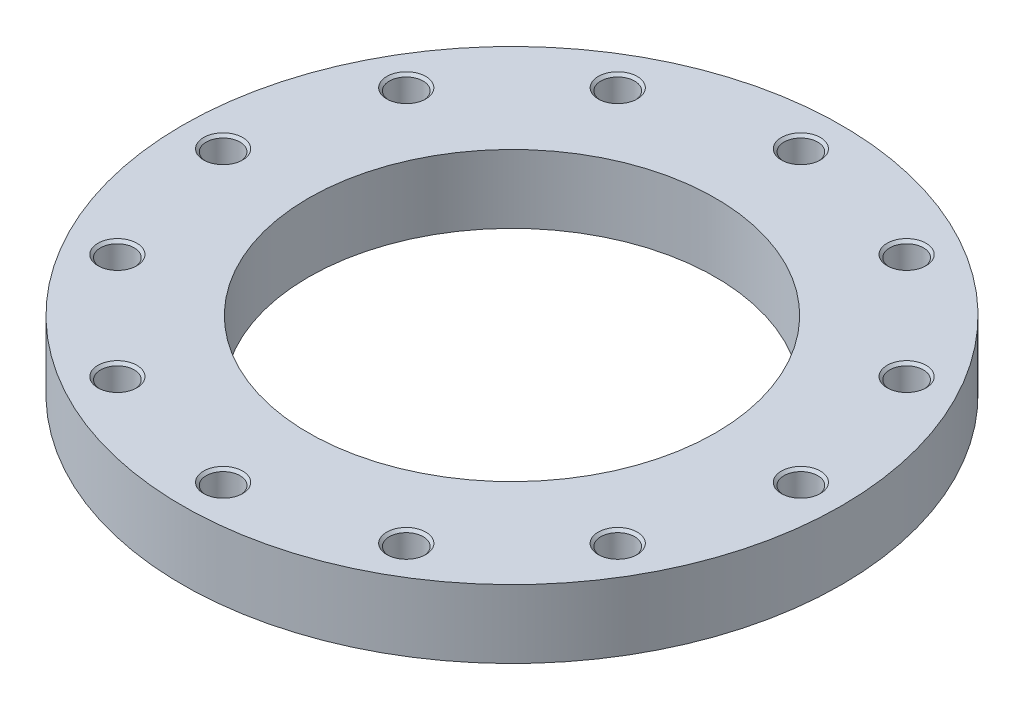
ISO-10303-21;
HEADER;
FILE_DESCRIPTION(('STEP AP214'),'2;1');
FILE_NAME('part.step','',(''),(''),'','','');
FILE_SCHEMA(('AUTOMOTIVE_DESIGN { 1 0 10303 214 1 1 1 1 }'));
ENDSEC;
DATA;
#1=APPLICATION_CONTEXT('core data for automotive mechanical design processes');
#2=APPLICATION_PROTOCOL_DEFINITION('international standard','automotive_design',2000,#1);
#3=PRODUCT_CONTEXT('',#1,'mechanical');
#4=PRODUCT('Part','Part','',(#3));
#5=PRODUCT_RELATED_PRODUCT_CATEGORY('part','',(#4));
#6=PRODUCT_DEFINITION_FORMATION('','',#4);
#7=PRODUCT_DEFINITION_CONTEXT('part definition',#1,'design');
#8=PRODUCT_DEFINITION('design','',#6,#7);
#9=PRODUCT_DEFINITION_SHAPE('','',#8);
#10=(LENGTH_UNIT() NAMED_UNIT(*) SI_UNIT(.MILLI.,.METRE.));
#11=(NAMED_UNIT(*) PLANE_ANGLE_UNIT() SI_UNIT($,.RADIAN.));
#12=(NAMED_UNIT(*) SI_UNIT($,.STERADIAN.) SOLID_ANGLE_UNIT());
#13=UNCERTAINTY_MEASURE_WITH_UNIT(LENGTH_MEASURE(1.E-05),#10,'distance_accuracy_value','');
#14=(GEOMETRIC_REPRESENTATION_CONTEXT(3) GLOBAL_UNCERTAINTY_ASSIGNED_CONTEXT((#13)) GLOBAL_UNIT_ASSIGNED_CONTEXT((#10,
#11,#12)) REPRESENTATION_CONTEXT('',''));
#15=CARTESIAN_POINT('',(0.,0.,0.));
#16=DIRECTION('',(0.,0.,1.));
#17=DIRECTION('',(1.,0.,0.));
#18=AXIS2_PLACEMENT_3D('',#15,#16,#17);
#19=CARTESIAN_POINT('',(0.,21.,0.));
#20=DIRECTION('',(0.,-1.,0.));
#21=DIRECTION('',(1.,0.,0.));
#22=AXIS2_PLACEMENT_3D('',#19,#20,#21);
#23=CYLINDRICAL_SURFACE('',#22,202.5);
#24=CARTESIAN_POINT('',(0.,0.,0.));
#25=DIRECTION('',(0.,1.,0.));
#26=DIRECTION('',(1.,0.,0.));
#27=AXIS2_PLACEMENT_3D('',#24,#25,#26);
#28=CIRCLE('',#27,202.5);
#29=CARTESIAN_POINT('',(202.5,0.,0.));
#30=VERTEX_POINT('',#29);
#31=EDGE_CURVE('E9',#30,#30,#28,.T.);
#32=ORIENTED_EDGE('',*,*,#31,.T.);
#33=EDGE_LOOP('',(#32));
#34=FACE_BOUND('',#33,.T.);
#35=CARTESIAN_POINT('',(0.,42.,0.));
#36=DIRECTION('',(0.,1.,0.));
#37=DIRECTION('',(1.,0.,0.));
#38=AXIS2_PLACEMENT_3D('',#35,#36,#37);
#39=CIRCLE('',#38,202.5);
#40=CARTESIAN_POINT('',(202.5,42.,0.));
#41=VERTEX_POINT('',#40);
#42=EDGE_CURVE('E306',#41,#41,#39,.T.);
#43=ORIENTED_EDGE('',*,*,#42,.F.);
#44=EDGE_LOOP('',(#43));
#45=FACE_BOUND('',#44,.T.);
#46=ADVANCED_FACE('F15',(#34,#45),#23,.T.);
#47=CARTESIAN_POINT('',(163.75,0.,0.));
#48=DIRECTION('',(0.,-1.,0.));
#49=DIRECTION('',(-1.,0.,0.));
#50=AXIS2_PLACEMENT_3D('',#47,#48,#49);
#51=PLANE('',#50);
#52=CARTESIAN_POINT('',(0.,0.,0.));
#53=DIRECTION('',(0.,1.,0.));
#54=DIRECTION('',(1.,0.,0.));
#55=AXIS2_PLACEMENT_3D('',#52,#53,#54);
#56=CIRCLE('',#55,125.);
#57=CARTESIAN_POINT('',(125.,0.,0.));
#58=VERTEX_POINT('',#57);
#59=EDGE_CURVE('E23',#58,#58,#56,.T.);
#60=ORIENTED_EDGE('',*,*,#59,.T.);
#61=EDGE_LOOP('',(#60));
#62=FACE_BOUND('',#61,.T.);
#63=ORIENTED_EDGE('',*,*,#31,.F.);
#64=EDGE_LOOP('',(#63));
#65=FACE_BOUND('',#64,.T.);
#66=ADVANCED_FACE('F443',(#62,#65),#51,.T.);
#67=CARTESIAN_POINT('',(0.,21.,0.));
#68=DIRECTION('',(0.,-1.,0.));
#69=DIRECTION('',(1.,0.,0.));
#70=AXIS2_PLACEMENT_3D('',#67,#68,#69);
#71=CYLINDRICAL_SURFACE('',#70,125.);
#72=CARTESIAN_POINT('',(0.,42.,0.));
#73=DIRECTION('',(0.,1.,0.));
#74=DIRECTION('',(1.,0.,0.));
#75=AXIS2_PLACEMENT_3D('',#72,#73,#74);
#76=CIRCLE('',#75,125.);
#77=CARTESIAN_POINT('',(125.,42.,0.));
#78=VERTEX_POINT('',#77);
#79=EDGE_CURVE('E184',#78,#78,#76,.T.);
#80=ORIENTED_EDGE('',*,*,#79,.T.);
#81=EDGE_LOOP('',(#80));
#82=FACE_BOUND('',#81,.T.);
#83=ORIENTED_EDGE('',*,*,#59,.F.);
#84=EDGE_LOOP('',(#83));
#85=FACE_BOUND('',#84,.T.);
#86=ADVANCED_FACE('F447',(#82,#85),#71,.F.);
#87=CARTESIAN_POINT('',(163.75,42.,0.));
#88=DIRECTION('',(0.,1.,0.));
#89=DIRECTION('',(1.,0.,0.));
#90=AXIS2_PLACEMENT_3D('',#87,#88,#89);
#91=PLANE('',#90);
#92=ORIENTED_EDGE('',*,*,#42,.T.);
#93=EDGE_LOOP('',(#92));
#94=FACE_BOUND('',#93,.T.);
#95=ORIENTED_EDGE('',*,*,#79,.F.);
#96=EDGE_LOOP('',(#95));
#97=FACE_BOUND('',#96,.T.);
#98=CARTESIAN_POINT('',(177.5,42.,0.));
#99=DIRECTION('',(0.,-1.,0.));
#100=DIRECTION('',(1.,0.,0.));
#101=AXIS2_PLACEMENT_3D('',#98,#99,#100);
#102=CIRCLE('',#101,12.);
#103=CARTESIAN_POINT('',(189.5,42.,0.));
#104=VERTEX_POINT('',#103);
#105=EDGE_CURVE('E324',#104,#104,#102,.T.);
#106=ORIENTED_EDGE('',*,*,#105,.T.);
#107=EDGE_LOOP('',(#106));
#108=FACE_BOUND('',#107,.T.);
#109=CARTESIAN_POINT('',(153.719509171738,42.,-88.75));
#110=DIRECTION('',(0.,-1.,0.));
#111=DIRECTION('',(0.866025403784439,0.,-0.5));
#112=AXIS2_PLACEMENT_3D('',#109,#110,#111);
#113=CIRCLE('',#112,12.);
#114=CARTESIAN_POINT('',(164.111814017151,42.,-94.75));
#115=VERTEX_POINT('',#114);
#116=EDGE_CURVE('E276',#115,#115,#113,.T.);
#117=ORIENTED_EDGE('',*,*,#116,.T.);
#118=EDGE_LOOP('',(#117));
#119=FACE_BOUND('',#118,.T.);
#120=CARTESIAN_POINT('',(88.75,42.,-153.719509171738));
#121=DIRECTION('',(0.,-1.,0.));
#122=DIRECTION('',(0.5,0.,-0.866025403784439));
#123=AXIS2_PLACEMENT_3D('',#120,#121,#122);
#124=CIRCLE('',#123,12.);
#125=CARTESIAN_POINT('',(94.75,42.,-164.111814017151));
#126=VERTEX_POINT('',#125);
#127=EDGE_CURVE('E302',#126,#126,#124,.T.);
#128=ORIENTED_EDGE('',*,*,#127,.T.);
#129=EDGE_LOOP('',(#128));
#130=FACE_BOUND('',#129,.T.);
#131=CARTESIAN_POINT('',(0.,42.,-177.5));
#132=DIRECTION('',(0.,-1.,0.));
#133=DIRECTION('',(0.,0.,-1.));
#134=AXIS2_PLACEMENT_3D('',#131,#132,#133);
#135=CIRCLE('',#134,12.);
#136=CARTESIAN_POINT('',(0.,42.,-189.5));
#137=VERTEX_POINT('',#136);
#138=EDGE_CURVE('E287',#137,#137,#135,.T.);
#139=ORIENTED_EDGE('',*,*,#138,.T.);
#140=EDGE_LOOP('',(#139));
#141=FACE_BOUND('',#140,.T.);
#142=CARTESIAN_POINT('',(-88.75,42.,-153.719509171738));
#143=DIRECTION('',(0.,-1.,0.));
#144=DIRECTION('',(-0.5,0.,-0.866025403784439));
#145=AXIS2_PLACEMENT_3D('',#142,#143,#144);
#146=CIRCLE('',#145,12.);
#147=CARTESIAN_POINT('',(-94.75,42.,-164.111814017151));
#148=VERTEX_POINT('',#147);
#149=EDGE_CURVE('E272',#148,#148,#146,.T.);
#150=ORIENTED_EDGE('',*,*,#149,.T.);
#151=EDGE_LOOP('',(#150));
#152=FACE_BOUND('',#151,.T.);
#153=CARTESIAN_POINT('',(-153.719509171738,42.,-88.75));
#154=DIRECTION('',(0.,-1.,0.));
#155=DIRECTION('',(-0.866025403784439,0.,-0.5));
#156=AXIS2_PLACEMENT_3D('',#153,#154,#155);
#157=CIRCLE('',#156,12.);
#158=CARTESIAN_POINT('',(-164.111814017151,42.,-94.75));
#159=VERTEX_POINT('',#158);
#160=EDGE_CURVE('E259',#159,#159,#157,.T.);
#161=ORIENTED_EDGE('',*,*,#160,.T.);
#162=EDGE_LOOP('',(#161));
#163=FACE_BOUND('',#162,.T.);
#164=CARTESIAN_POINT('',(-177.5,42.,0.));
#165=DIRECTION('',(0.,-1.,0.));
#166=DIRECTION('',(-1.,0.,0.));
#167=AXIS2_PLACEMENT_3D('',#164,#165,#166);
#168=CIRCLE('',#167,12.);
#169=CARTESIAN_POINT('',(-189.5,42.,0.));
#170=VERTEX_POINT('',#169);
#171=EDGE_CURVE('E248',#170,#170,#168,.T.);
#172=ORIENTED_EDGE('',*,*,#171,.T.);
#173=EDGE_LOOP('',(#172));
#174=FACE_BOUND('',#173,.T.);
#175=CARTESIAN_POINT('',(-153.719509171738,42.,88.75));
#176=DIRECTION('',(0.,-1.,0.));
#177=DIRECTION('',(-0.866025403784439,0.,0.5));
#178=AXIS2_PLACEMENT_3D('',#175,#176,#177);
#179=CIRCLE('',#178,12.);
#180=CARTESIAN_POINT('',(-164.111814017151,42.,94.75));
#181=VERTEX_POINT('',#180);
#182=EDGE_CURVE('E234',#181,#181,#179,.T.);
#183=ORIENTED_EDGE('',*,*,#182,.T.);
#184=EDGE_LOOP('',(#183));
#185=FACE_BOUND('',#184,.T.);
#186=CARTESIAN_POINT('',(-88.75,42.,153.719509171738));
#187=DIRECTION('',(0.,-1.,0.));
#188=DIRECTION('',(-0.5,0.,0.866025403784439));
#189=AXIS2_PLACEMENT_3D('',#186,#187,#188);
#190=CIRCLE('',#189,12.);
#191=CARTESIAN_POINT('',(-94.75,42.,164.111814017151));
#192=VERTEX_POINT('',#191);
#193=EDGE_CURVE('E357',#192,#192,#190,.T.);
#194=ORIENTED_EDGE('',*,*,#193,.T.);
#195=EDGE_LOOP('',(#194));
#196=FACE_BOUND('',#195,.T.);
#197=CARTESIAN_POINT('',(0.,42.,177.5));
#198=DIRECTION('',(0.,-1.,0.));
#199=DIRECTION('',(0.,0.,1.));
#200=AXIS2_PLACEMENT_3D('',#197,#198,#199);
#201=CIRCLE('',#200,12.);
#202=CARTESIAN_POINT('',(0.,42.,189.5));
#203=VERTEX_POINT('',#202);
#204=EDGE_CURVE('E346',#203,#203,#201,.T.);
#205=ORIENTED_EDGE('',*,*,#204,.T.);
#206=EDGE_LOOP('',(#205));
#207=FACE_BOUND('',#206,.T.);
#208=CARTESIAN_POINT('',(88.75,42.,153.719509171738));
#209=DIRECTION('',(0.,-1.,0.));
#210=DIRECTION('',(0.5,0.,0.866025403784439));
#211=AXIS2_PLACEMENT_3D('',#208,#209,#210);
#212=CIRCLE('',#211,12.);
#213=CARTESIAN_POINT('',(94.75,42.,164.111814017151));
#214=VERTEX_POINT('',#213);
#215=EDGE_CURVE('E373',#214,#214,#212,.T.);
#216=ORIENTED_EDGE('',*,*,#215,.T.);
#217=EDGE_LOOP('',(#216));
#218=FACE_BOUND('',#217,.T.);
#219=CARTESIAN_POINT('',(153.719509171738,42.,88.75));
#220=DIRECTION('',(0.,-1.,0.));
#221=DIRECTION('',(0.866025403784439,0.,0.5));
#222=AXIS2_PLACEMENT_3D('',#219,#220,#221);
#223=CIRCLE('',#222,12.);
#224=CARTESIAN_POINT('',(164.111814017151,42.,94.75));
#225=VERTEX_POINT('',#224);
#226=EDGE_CURVE('E382',#225,#225,#223,.T.);
#227=ORIENTED_EDGE('',*,*,#226,.T.);
#228=EDGE_LOOP('',(#227));
#229=FACE_BOUND('',#228,.T.);
#230=ADVANCED_FACE('F415',(#94,#97,#108,#119,#130,#141,#152,#163,#174,#185,#196,#207,#218,#229),
#91,.T.);
#231=CARTESIAN_POINT('',(177.5,6.00463463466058,0.));
#232=DIRECTION('',(0.,1.,0.));
#233=DIRECTION('',(1.,0.,0.));
#234=AXIS2_PLACEMENT_3D('',#231,#232,#233);
#235=CONICAL_SURFACE('',#234,5.188125,1.0471975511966);
#236=CARTESIAN_POINT('',(177.5,9.,0.));
#237=DIRECTION('',(0.,-1.,0.));
#238=DIRECTION('',(1.,0.,0.));
#239=AXIS2_PLACEMENT_3D('',#236,#237,#238);
#240=CIRCLE('',#239,10.37625);
#241=CARTESIAN_POINT('',(187.87625,9.,0.));
#242=VERTEX_POINT('',#241);
#243=EDGE_CURVE('E190',#242,#242,#240,.T.);
#244=ORIENTED_EDGE('',*,*,#243,.F.);
#245=EDGE_LOOP('',(#244));
#246=FACE_BOUND('',#245,.T.);
#247=CARTESIAN_POINT('',(177.5,3.00926926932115,0.));
#248=VERTEX_POINT('',#247);
#249=VERTEX_LOOP('',#248);
#250=FACE_BOUND('',#249,.T.);
#251=ADVANCED_FACE('F455',(#246,#250),#235,.F.);
#252=CARTESIAN_POINT('',(177.5,12.688125,0.));
#253=DIRECTION('',(0.,1.,0.));
#254=DIRECTION('',(1.,0.,0.));
#255=AXIS2_PLACEMENT_3D('',#252,#253,#254);
#256=CYLINDRICAL_SURFACE('',#255,10.37625);
#257=CARTESIAN_POINT('',(177.5,16.37625,0.));
#258=DIRECTION('',(0.,-1.,0.));
#259=DIRECTION('',(1.,0.,0.));
#260=AXIS2_PLACEMENT_3D('',#257,#258,#259);
#261=CIRCLE('',#260,10.37625);
#262=CARTESIAN_POINT('',(187.87625,16.37625,0.));
#263=VERTEX_POINT('',#262);
#264=EDGE_CURVE('E327',#263,#263,#261,.T.);
#265=ORIENTED_EDGE('',*,*,#264,.F.);
#266=EDGE_LOOP('',(#265));
#267=FACE_BOUND('',#266,.T.);
#268=ORIENTED_EDGE('',*,*,#243,.T.);
#269=EDGE_LOOP('',(#268));
#270=FACE_BOUND('',#269,.T.);
#271=ADVANCED_FACE('F537',(#267,#270),#256,.F.);
#272=CARTESIAN_POINT('',(177.5,17.188125,0.));
#273=DIRECTION('',(0.,1.,0.));
#274=DIRECTION('',(1.,0.,0.));
#275=AXIS2_PLACEMENT_3D('',#272,#273,#274);
#276=CONICAL_SURFACE('',#275,11.188125,0.785398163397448);
#277=CARTESIAN_POINT('',(177.5,18.,0.));
#278=DIRECTION('',(0.,-1.,0.));
#279=DIRECTION('',(1.,0.,0.));
#280=AXIS2_PLACEMENT_3D('',#277,#278,#279);
#281=CIRCLE('',#280,12.);
#282=CARTESIAN_POINT('',(189.5,18.,0.));
#283=VERTEX_POINT('',#282);
#284=EDGE_CURVE('E329',#283,#283,#281,.T.);
#285=ORIENTED_EDGE('',*,*,#284,.F.);
#286=EDGE_LOOP('',(#285));
#287=FACE_BOUND('',#286,.T.);
#288=ORIENTED_EDGE('',*,*,#264,.T.);
#289=EDGE_LOOP('',(#288));
#290=FACE_BOUND('',#289,.T.);
#291=ADVANCED_FACE('F540',(#287,#290),#276,.F.);
#292=CARTESIAN_POINT('',(188.688125,18.,0.));
#293=DIRECTION('',(0.,1.,0.));
#294=DIRECTION('',(-1.,0.,0.));
#295=AXIS2_PLACEMENT_3D('',#292,#293,#294);
#296=PLANE('',#295);
#297=CARTESIAN_POINT('',(177.5,18.,0.));
#298=DIRECTION('',(0.,-1.,0.));
#299=DIRECTION('',(1.,0.,0.));
#300=AXIS2_PLACEMENT_3D('',#297,#298,#299);
#301=CIRCLE('',#300,10.37625);
#302=CARTESIAN_POINT('',(187.87625,18.,0.));
#303=VERTEX_POINT('',#302);
#304=EDGE_CURVE('E326',#303,#303,#301,.T.);
#305=ORIENTED_EDGE('',*,*,#304,.F.);
#306=EDGE_LOOP('',(#305));
#307=FACE_BOUND('',#306,.T.);
#308=ORIENTED_EDGE('',*,*,#284,.T.);
#309=EDGE_LOOP('',(#308));
#310=FACE_BOUND('',#309,.T.);
#311=ADVANCED_FACE('F648',(#307,#310),#296,.F.);
#312=CARTESIAN_POINT('',(177.5,29.188125,0.));
#313=DIRECTION('',(0.,1.,0.));
#314=DIRECTION('',(1.,0.,0.));
#315=AXIS2_PLACEMENT_3D('',#312,#313,#314);
#316=CYLINDRICAL_SURFACE('',#315,10.37625);
#317=CARTESIAN_POINT('',(177.5,40.37625,0.));
#318=DIRECTION('',(0.,-1.,0.));
#319=DIRECTION('',(1.,0.,0.));
#320=AXIS2_PLACEMENT_3D('',#317,#318,#319);
#321=CIRCLE('',#320,10.37625);
#322=CARTESIAN_POINT('',(187.87625,40.37625,0.));
#323=VERTEX_POINT('',#322);
#324=EDGE_CURVE('E321',#323,#323,#321,.T.);
#325=ORIENTED_EDGE('',*,*,#324,.F.);
#326=EDGE_LOOP('',(#325));
#327=FACE_BOUND('',#326,.T.);
#328=ORIENTED_EDGE('',*,*,#304,.T.);
#329=EDGE_LOOP('',(#328));
#330=FACE_BOUND('',#329,.T.);
#331=ADVANCED_FACE('F693',(#327,#330),#316,.F.);
#332=CARTESIAN_POINT('',(177.5,41.188125,0.));
#333=DIRECTION('',(0.,1.,0.));
#334=DIRECTION('',(1.,0.,0.));
#335=AXIS2_PLACEMENT_3D('',#332,#333,#334);
#336=CONICAL_SURFACE('',#335,11.188125,0.785398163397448);
#337=ORIENTED_EDGE('',*,*,#105,.F.);
#338=EDGE_LOOP('',(#337));
#339=FACE_BOUND('',#338,.T.);
#340=ORIENTED_EDGE('',*,*,#324,.T.);
#341=EDGE_LOOP('',(#340));
#342=FACE_BOUND('',#341,.T.);
#343=ADVANCED_FACE('F689',(#339,#342),#336,.F.);
#344=CARTESIAN_POINT('',(153.719509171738,6.00463463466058,-88.75));
#345=DIRECTION('',(0.,1.,0.));
#346=DIRECTION('',(0.866025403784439,0.,-0.5));
#347=AXIS2_PLACEMENT_3D('',#344,#345,#346);
#348=CONICAL_SURFACE('',#347,5.188125,1.0471975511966);
#349=CARTESIAN_POINT('',(153.719509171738,9.,-88.75));
#350=DIRECTION('',(0.,-1.,0.));
#351=DIRECTION('',(0.866025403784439,0.,-0.5));
#352=AXIS2_PLACEMENT_3D('',#349,#350,#351);
#353=CIRCLE('',#352,10.37625);
#354=CARTESIAN_POINT('',(162.705605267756,9.,-93.938125));
#355=VERTEX_POINT('',#354);
#356=EDGE_CURVE('E297',#355,#355,#353,.T.);
#357=ORIENTED_EDGE('',*,*,#356,.F.);
#358=EDGE_LOOP('',(#357));
#359=FACE_BOUND('',#358,.T.);
#360=CARTESIAN_POINT('',(153.719509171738,3.00926926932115,-88.75));
#361=VERTEX_POINT('',#360);
#362=VERTEX_LOOP('',#361);
#363=FACE_BOUND('',#362,.T.);
#364=ADVANCED_FACE('F692',(#359,#363),#348,.F.);
#365=CARTESIAN_POINT('',(153.719509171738,12.688125,-88.75));
#366=DIRECTION('',(0.,1.,0.));
#367=DIRECTION('',(0.866025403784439,0.,-0.5));
#368=AXIS2_PLACEMENT_3D('',#365,#366,#367);
#369=CYLINDRICAL_SURFACE('',#368,10.37625);
#370=CARTESIAN_POINT('',(153.719509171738,16.37625,-88.75));
#371=DIRECTION('',(0.,-1.,0.));
#372=DIRECTION('',(0.866025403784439,0.,-0.5));
#373=AXIS2_PLACEMENT_3D('',#370,#371,#372);
#374=CIRCLE('',#373,10.37625);
#375=CARTESIAN_POINT('',(162.705605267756,16.37625,-93.938125));
#376=VERTEX_POINT('',#375);
#377=EDGE_CURVE('E295',#376,#376,#374,.T.);
#378=ORIENTED_EDGE('',*,*,#377,.F.);
#379=EDGE_LOOP('',(#378));
#380=FACE_BOUND('',#379,.T.);
#381=ORIENTED_EDGE('',*,*,#356,.T.);
#382=EDGE_LOOP('',(#381));
#383=FACE_BOUND('',#382,.T.);
#384=ADVANCED_FACE('F629',(#380,#383),#369,.F.);
#385=CARTESIAN_POINT('',(153.719509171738,17.188125,-88.75));
#386=DIRECTION('',(0.,1.,0.));
#387=DIRECTION('',(0.866025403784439,0.,-0.5));
#388=AXIS2_PLACEMENT_3D('',#385,#386,#387);
#389=CONICAL_SURFACE('',#388,11.188125,0.785398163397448);
#390=CARTESIAN_POINT('',(153.719509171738,18.,-88.75));
#391=DIRECTION('',(0.,-1.,0.));
#392=DIRECTION('',(0.866025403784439,0.,-0.5));
#393=AXIS2_PLACEMENT_3D('',#390,#391,#392);
#394=CIRCLE('',#393,12.);
#395=CARTESIAN_POINT('',(164.111814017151,18.,-94.75));
#396=VERTEX_POINT('',#395);
#397=EDGE_CURVE('E275',#396,#396,#394,.T.);
#398=ORIENTED_EDGE('',*,*,#397,.F.);
#399=EDGE_LOOP('',(#398));
#400=FACE_BOUND('',#399,.T.);
#401=ORIENTED_EDGE('',*,*,#377,.T.);
#402=EDGE_LOOP('',(#401));
#403=FACE_BOUND('',#402,.T.);
#404=ADVANCED_FACE('F625',(#400,#403),#389,.F.);
#405=CARTESIAN_POINT('',(163.408709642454,18.,-94.3440625));
#406=DIRECTION('',(0.,1.,0.));
#407=DIRECTION('',(-0.866025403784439,0.,0.5));
#408=AXIS2_PLACEMENT_3D('',#405,#406,#407);
#409=PLANE('',#408);
#410=CARTESIAN_POINT('',(153.719509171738,18.,-88.75));
#411=DIRECTION('',(0.,-1.,0.));
#412=DIRECTION('',(0.866025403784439,0.,-0.5));
#413=AXIS2_PLACEMENT_3D('',#410,#411,#412);
#414=CIRCLE('',#413,10.37625);
#415=CARTESIAN_POINT('',(162.705605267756,18.,-93.938125));
#416=VERTEX_POINT('',#415);
#417=EDGE_CURVE('E273',#416,#416,#414,.T.);
#418=ORIENTED_EDGE('',*,*,#417,.F.);
#419=EDGE_LOOP('',(#418));
#420=FACE_BOUND('',#419,.T.);
#421=ORIENTED_EDGE('',*,*,#397,.T.);
#422=EDGE_LOOP('',(#421));
#423=FACE_BOUND('',#422,.T.);
#424=ADVANCED_FACE('F628',(#420,#423),#409,.F.);
#425=CARTESIAN_POINT('',(153.719509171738,29.188125,-88.75));
#426=DIRECTION('',(0.,1.,0.));
#427=DIRECTION('',(0.866025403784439,0.,-0.5));
#428=AXIS2_PLACEMENT_3D('',#425,#426,#427);
#429=CYLINDRICAL_SURFACE('',#428,10.37625);
#430=CARTESIAN_POINT('',(153.719509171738,40.37625,-88.75));
#431=DIRECTION('',(0.,-1.,0.));
#432=DIRECTION('',(0.866025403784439,0.,-0.5));
#433=AXIS2_PLACEMENT_3D('',#430,#431,#432);
#434=CIRCLE('',#433,10.37625);
#435=CARTESIAN_POINT('',(162.705605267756,40.37625,-93.938125));
#436=VERTEX_POINT('',#435);
#437=EDGE_CURVE('E317',#436,#436,#434,.T.);
#438=ORIENTED_EDGE('',*,*,#437,.F.);
#439=EDGE_LOOP('',(#438));
#440=FACE_BOUND('',#439,.T.);
#441=ORIENTED_EDGE('',*,*,#417,.T.);
#442=EDGE_LOOP('',(#441));
#443=FACE_BOUND('',#442,.T.);
#444=ADVANCED_FACE('F681',(#440,#443),#429,.F.);
#445=CARTESIAN_POINT('',(153.719509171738,41.188125,-88.75));
#446=DIRECTION('',(0.,1.,0.));
#447=DIRECTION('',(0.866025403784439,0.,-0.5));
#448=AXIS2_PLACEMENT_3D('',#445,#446,#447);
#449=CONICAL_SURFACE('',#448,11.188125,0.785398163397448);
#450=ORIENTED_EDGE('',*,*,#116,.F.);
#451=EDGE_LOOP('',(#450));
#452=FACE_BOUND('',#451,.T.);
#453=ORIENTED_EDGE('',*,*,#437,.T.);
#454=EDGE_LOOP('',(#453));
#455=FACE_BOUND('',#454,.T.);
#456=ADVANCED_FACE('F677',(#452,#455),#449,.F.);
#457=CARTESIAN_POINT('',(88.75,6.00463463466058,-153.719509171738));
#458=DIRECTION('',(0.,1.,0.));
#459=DIRECTION('',(0.5,0.,-0.866025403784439));
#460=AXIS2_PLACEMENT_3D('',#457,#458,#459);
#461=CONICAL_SURFACE('',#460,5.188125,1.0471975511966);
#462=CARTESIAN_POINT('',(88.75,9.,-153.719509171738));
#463=DIRECTION('',(0.,-1.,0.));
#464=DIRECTION('',(0.5,0.,-0.866025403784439));
#465=AXIS2_PLACEMENT_3D('',#462,#463,#464);
#466=CIRCLE('',#465,10.37625);
#467=CARTESIAN_POINT('',(93.938125,9.,-162.705605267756));
#468=VERTEX_POINT('',#467);
#469=EDGE_CURVE('E315',#468,#468,#466,.T.);
#470=ORIENTED_EDGE('',*,*,#469,.F.);
#471=EDGE_LOOP('',(#470));
#472=FACE_BOUND('',#471,.T.);
#473=CARTESIAN_POINT('',(88.75,3.00926926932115,-153.719509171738));
#474=VERTEX_POINT('',#473);
#475=VERTEX_LOOP('',#474);
#476=FACE_BOUND('',#475,.T.);
#477=ADVANCED_FACE('F673',(#472,#476),#461,.F.);
#478=CARTESIAN_POINT('',(88.75,12.688125,-153.719509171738));
#479=DIRECTION('',(0.,1.,0.));
#480=DIRECTION('',(0.5,0.,-0.866025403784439));
#481=AXIS2_PLACEMENT_3D('',#478,#479,#480);
#482=CYLINDRICAL_SURFACE('',#481,10.37625);
#483=CARTESIAN_POINT('',(88.75,16.37625,-153.719509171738));
#484=DIRECTION('',(0.,-1.,0.));
#485=DIRECTION('',(0.5,0.,-0.866025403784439));
#486=AXIS2_PLACEMENT_3D('',#483,#484,#485);
#487=CIRCLE('',#486,10.37625);
#488=CARTESIAN_POINT('',(93.938125,16.37625,-162.705605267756));
#489=VERTEX_POINT('',#488);
#490=EDGE_CURVE('E311',#489,#489,#487,.T.);
#491=ORIENTED_EDGE('',*,*,#490,.F.);
#492=EDGE_LOOP('',(#491));
#493=FACE_BOUND('',#492,.T.);
#494=ORIENTED_EDGE('',*,*,#469,.T.);
#495=EDGE_LOOP('',(#494));
#496=FACE_BOUND('',#495,.T.);
#497=ADVANCED_FACE('F669',(#493,#496),#482,.F.);
#498=CARTESIAN_POINT('',(88.75,17.188125,-153.719509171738));
#499=DIRECTION('',(0.,1.,0.));
#500=DIRECTION('',(0.5,0.,-0.866025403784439));
#501=AXIS2_PLACEMENT_3D('',#498,#499,#500);
#502=CONICAL_SURFACE('',#501,11.188125,0.785398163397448);
#503=CARTESIAN_POINT('',(88.75,18.,-153.719509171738));
#504=DIRECTION('',(0.,-1.,0.));
#505=DIRECTION('',(0.5,0.,-0.866025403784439));
#506=AXIS2_PLACEMENT_3D('',#503,#504,#505);
#507=CIRCLE('',#506,12.);
#508=CARTESIAN_POINT('',(94.75,18.,-164.111814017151));
#509=VERTEX_POINT('',#508);
#510=EDGE_CURVE('E309',#509,#509,#507,.T.);
#511=ORIENTED_EDGE('',*,*,#510,.F.);
#512=EDGE_LOOP('',(#511));
#513=FACE_BOUND('',#512,.T.);
#514=ORIENTED_EDGE('',*,*,#490,.T.);
#515=EDGE_LOOP('',(#514));
#516=FACE_BOUND('',#515,.T.);
#517=ADVANCED_FACE('F665',(#513,#516),#502,.F.);
#518=CARTESIAN_POINT('',(94.3440625,18.,-163.408709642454));
#519=DIRECTION('',(0.,1.,0.));
#520=DIRECTION('',(-0.5,0.,0.866025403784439));
#521=AXIS2_PLACEMENT_3D('',#518,#519,#520);
#522=PLANE('',#521);
#523=CARTESIAN_POINT('',(88.75,18.,-153.719509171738));
#524=DIRECTION('',(0.,-1.,0.));
#525=DIRECTION('',(0.5,0.,-0.866025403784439));
#526=AXIS2_PLACEMENT_3D('',#523,#524,#525);
#527=CIRCLE('',#526,10.37625);
#528=CARTESIAN_POINT('',(93.938125,18.,-162.705605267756));
#529=VERTEX_POINT('',#528);
#530=EDGE_CURVE('E305',#529,#529,#527,.T.);
#531=ORIENTED_EDGE('',*,*,#530,.F.);
#532=EDGE_LOOP('',(#531));
#533=FACE_BOUND('',#532,.T.);
#534=ORIENTED_EDGE('',*,*,#510,.T.);
#535=EDGE_LOOP('',(#534));
#536=FACE_BOUND('',#535,.T.);
#537=ADVANCED_FACE('F662',(#533,#536),#522,.F.);
#538=CARTESIAN_POINT('',(88.75,29.188125,-153.719509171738));
#539=DIRECTION('',(0.,1.,0.));
#540=DIRECTION('',(0.5,0.,-0.866025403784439));
#541=AXIS2_PLACEMENT_3D('',#538,#539,#540);
#542=CYLINDRICAL_SURFACE('',#541,10.37625);
#543=CARTESIAN_POINT('',(88.75,40.37625,-153.719509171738));
#544=DIRECTION('',(0.,-1.,0.));
#545=DIRECTION('',(0.5,0.,-0.866025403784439));
#546=AXIS2_PLACEMENT_3D('',#543,#544,#545);
#547=CIRCLE('',#546,10.37625);
#548=CARTESIAN_POINT('',(93.938125,40.37625,-162.705605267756));
#549=VERTEX_POINT('',#548);
#550=EDGE_CURVE('E299',#549,#549,#547,.T.);
#551=ORIENTED_EDGE('',*,*,#550,.F.);
#552=EDGE_LOOP('',(#551));
#553=FACE_BOUND('',#552,.T.);
#554=ORIENTED_EDGE('',*,*,#530,.T.);
#555=EDGE_LOOP('',(#554));
#556=FACE_BOUND('',#555,.T.);
#557=ADVANCED_FACE('F660',(#553,#556),#542,.F.);
#558=CARTESIAN_POINT('',(88.75,41.188125,-153.719509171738));
#559=DIRECTION('',(0.,1.,0.));
#560=DIRECTION('',(0.5,0.,-0.866025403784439));
#561=AXIS2_PLACEMENT_3D('',#558,#559,#560);
#562=CONICAL_SURFACE('',#561,11.188125,0.785398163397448);
#563=ORIENTED_EDGE('',*,*,#127,.F.);
#564=EDGE_LOOP('',(#563));
#565=FACE_BOUND('',#564,.T.);
#566=ORIENTED_EDGE('',*,*,#550,.T.);
#567=EDGE_LOOP('',(#566));
#568=FACE_BOUND('',#567,.T.);
#569=ADVANCED_FACE('F656',(#565,#568),#562,.F.);
#570=CARTESIAN_POINT('',(0.,6.00463463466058,-177.5));
#571=DIRECTION('',(0.,1.,0.));
#572=DIRECTION('',(0.,0.,-1.));
#573=AXIS2_PLACEMENT_3D('',#570,#571,#572);
#574=CONICAL_SURFACE('',#573,5.188125,1.0471975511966);
#575=CARTESIAN_POINT('',(0.,9.,-177.5));
#576=DIRECTION('',(0.,-1.,0.));
#577=DIRECTION('',(0.,0.,-1.));
#578=AXIS2_PLACEMENT_3D('',#575,#576,#577);
#579=CIRCLE('',#578,10.37625);
#580=CARTESIAN_POINT('',(0.,9.,-187.87625));
#581=VERTEX_POINT('',#580);
#582=EDGE_CURVE('E294',#581,#581,#579,.T.);
#583=ORIENTED_EDGE('',*,*,#582,.F.);
#584=EDGE_LOOP('',(#583));
#585=FACE_BOUND('',#584,.T.);
#586=CARTESIAN_POINT('',(0.,3.00926926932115,-177.5));
#587=VERTEX_POINT('',#586);
#588=VERTEX_LOOP('',#587);
#589=FACE_BOUND('',#588,.T.);
#590=ADVANCED_FACE('F653',(#585,#589),#574,.F.);
#591=CARTESIAN_POINT('',(0.,12.688125,-177.5));
#592=DIRECTION('',(0.,1.,0.));
#593=DIRECTION('',(0.,0.,-1.));
#594=AXIS2_PLACEMENT_3D('',#591,#592,#593);
#595=CYLINDRICAL_SURFACE('',#594,10.37625);
#596=CARTESIAN_POINT('',(0.,16.37625,-177.5));
#597=DIRECTION('',(0.,-1.,0.));
#598=DIRECTION('',(0.,0.,-1.));
#599=AXIS2_PLACEMENT_3D('',#596,#597,#598);
#600=CIRCLE('',#599,10.37625);
#601=CARTESIAN_POINT('',(0.,16.37625,-187.87625));
#602=VERTEX_POINT('',#601);
#603=EDGE_CURVE('E292',#602,#602,#600,.T.);
#604=ORIENTED_EDGE('',*,*,#603,.F.);
#605=EDGE_LOOP('',(#604));
#606=FACE_BOUND('',#605,.T.);
#607=ORIENTED_EDGE('',*,*,#582,.T.);
#608=EDGE_LOOP('',(#607));
#609=FACE_BOUND('',#608,.T.);
#610=ADVANCED_FACE('F547',(#606,#609),#595,.F.);
#611=CARTESIAN_POINT('',(0.,17.188125,-177.5));
#612=DIRECTION('',(0.,1.,0.));
#613=DIRECTION('',(0.,0.,-1.));
#614=AXIS2_PLACEMENT_3D('',#611,#612,#613);
#615=CONICAL_SURFACE('',#614,11.188125,0.785398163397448);
#616=CARTESIAN_POINT('',(0.,18.,-177.5));
#617=DIRECTION('',(0.,-1.,0.));
#618=DIRECTION('',(0.,0.,-1.));
#619=AXIS2_PLACEMENT_3D('',#616,#617,#618);
#620=CIRCLE('',#619,12.);
#621=CARTESIAN_POINT('',(0.,18.,-189.5));
#622=VERTEX_POINT('',#621);
#623=EDGE_CURVE('E290',#622,#622,#620,.T.);
#624=ORIENTED_EDGE('',*,*,#623,.F.);
#625=EDGE_LOOP('',(#624));
#626=FACE_BOUND('',#625,.T.);
#627=ORIENTED_EDGE('',*,*,#603,.T.);
#628=EDGE_LOOP('',(#627));
#629=FACE_BOUND('',#628,.T.);
#630=ADVANCED_FACE('F530',(#626,#629),#615,.F.);
#631=CARTESIAN_POINT('',(0.,18.,-188.688125));
#632=DIRECTION('',(0.,1.,0.));
#633=DIRECTION('',(0.,0.,1.));
#634=AXIS2_PLACEMENT_3D('',#631,#632,#633);
#635=PLANE('',#634);
#636=CARTESIAN_POINT('',(0.,18.,-177.5));
#637=DIRECTION('',(0.,-1.,0.));
#638=DIRECTION('',(0.,0.,-1.));
#639=AXIS2_PLACEMENT_3D('',#636,#637,#638);
#640=CIRCLE('',#639,10.37625);
#641=CARTESIAN_POINT('',(0.,18.,-187.87625));
#642=VERTEX_POINT('',#641);
#643=EDGE_CURVE('E289',#642,#642,#640,.T.);
#644=ORIENTED_EDGE('',*,*,#643,.F.);
#645=EDGE_LOOP('',(#644));
#646=FACE_BOUND('',#645,.T.);
#647=ORIENTED_EDGE('',*,*,#623,.T.);
#648=EDGE_LOOP('',(#647));
#649=FACE_BOUND('',#648,.T.);
#650=ADVANCED_FACE('F527',(#646,#649),#635,.F.);
#651=CARTESIAN_POINT('',(0.,29.188125,-177.5));
#652=DIRECTION('',(0.,1.,0.));
#653=DIRECTION('',(0.,0.,-1.));
#654=AXIS2_PLACEMENT_3D('',#651,#652,#653);
#655=CYLINDRICAL_SURFACE('',#654,10.37625);
#656=CARTESIAN_POINT('',(0.,40.37625,-177.5));
#657=DIRECTION('',(0.,-1.,0.));
#658=DIRECTION('',(0.,0.,-1.));
#659=AXIS2_PLACEMENT_3D('',#656,#657,#658);
#660=CIRCLE('',#659,10.37625);
#661=CARTESIAN_POINT('',(0.,40.37625,-187.87625));
#662=VERTEX_POINT('',#661);
#663=EDGE_CURVE('E286',#662,#662,#660,.T.);
#664=ORIENTED_EDGE('',*,*,#663,.F.);
#665=EDGE_LOOP('',(#664));
#666=FACE_BOUND('',#665,.T.);
#667=ORIENTED_EDGE('',*,*,#643,.T.);
#668=EDGE_LOOP('',(#667));
#669=FACE_BOUND('',#668,.T.);
#670=ADVANCED_FACE('F529',(#666,#669),#655,.F.);
#671=CARTESIAN_POINT('',(0.,41.188125,-177.5));
#672=DIRECTION('',(0.,1.,0.));
#673=DIRECTION('',(0.,0.,-1.));
#674=AXIS2_PLACEMENT_3D('',#671,#672,#673);
#675=CONICAL_SURFACE('',#674,11.188125,0.785398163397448);
#676=ORIENTED_EDGE('',*,*,#138,.F.);
#677=EDGE_LOOP('',(#676));
#678=FACE_BOUND('',#677,.T.);
#679=ORIENTED_EDGE('',*,*,#663,.T.);
#680=EDGE_LOOP('',(#679));
#681=FACE_BOUND('',#680,.T.);
#682=ADVANCED_FACE('F641',(#678,#681),#675,.F.);
#683=CARTESIAN_POINT('',(-88.75,6.00463463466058,-153.719509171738));
#684=DIRECTION('',(0.,1.,0.));
#685=DIRECTION('',(-0.5,0.,-0.866025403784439));
#686=AXIS2_PLACEMENT_3D('',#683,#684,#685);
#687=CONICAL_SURFACE('',#686,5.188125,1.0471975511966);
#688=CARTESIAN_POINT('',(-88.75,9.,-153.719509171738));
#689=DIRECTION('',(0.,-1.,0.));
#690=DIRECTION('',(-0.5,0.,-0.866025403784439));
#691=AXIS2_PLACEMENT_3D('',#688,#689,#690);
#692=CIRCLE('',#691,10.37625);
#693=CARTESIAN_POINT('',(-93.938125,9.,-162.705605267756));
#694=VERTEX_POINT('',#693);
#695=EDGE_CURVE('E283',#694,#694,#692,.T.);
#696=ORIENTED_EDGE('',*,*,#695,.F.);
#697=EDGE_LOOP('',(#696));
#698=FACE_BOUND('',#697,.T.);
#699=CARTESIAN_POINT('',(-88.75,3.00926926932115,-153.719509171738));
#700=VERTEX_POINT('',#699);
#701=VERTEX_LOOP('',#700);
#702=FACE_BOUND('',#701,.T.);
#703=ADVANCED_FACE('F637',(#698,#702),#687,.F.);
#704=CARTESIAN_POINT('',(-88.75,12.688125,-153.719509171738));
#705=DIRECTION('',(0.,1.,0.));
#706=DIRECTION('',(-0.5,0.,-0.866025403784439));
#707=AXIS2_PLACEMENT_3D('',#704,#705,#706);
#708=CYLINDRICAL_SURFACE('',#707,10.37625);
#709=CARTESIAN_POINT('',(-88.75,16.37625,-153.719509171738));
#710=DIRECTION('',(0.,-1.,0.));
#711=DIRECTION('',(-0.5,0.,-0.866025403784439));
#712=AXIS2_PLACEMENT_3D('',#709,#710,#711);
#713=CIRCLE('',#712,10.37625);
#714=CARTESIAN_POINT('',(-93.938125,16.37625,-162.705605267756));
#715=VERTEX_POINT('',#714);
#716=EDGE_CURVE('E282',#715,#715,#713,.T.);
#717=ORIENTED_EDGE('',*,*,#716,.F.);
#718=EDGE_LOOP('',(#717));
#719=FACE_BOUND('',#718,.T.);
#720=ORIENTED_EDGE('',*,*,#695,.T.);
#721=EDGE_LOOP('',(#720));
#722=FACE_BOUND('',#721,.T.);
#723=ADVANCED_FACE('F633',(#719,#722),#708,.F.);
#724=CARTESIAN_POINT('',(-88.75,17.188125,-153.719509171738));
#725=DIRECTION('',(0.,1.,0.));
#726=DIRECTION('',(-0.5,0.,-0.866025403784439));
#727=AXIS2_PLACEMENT_3D('',#724,#725,#726);
#728=CONICAL_SURFACE('',#727,11.188125,0.785398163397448);
#729=CARTESIAN_POINT('',(-88.75,18.,-153.719509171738));
#730=DIRECTION('',(0.,-1.,0.));
#731=DIRECTION('',(-0.5,0.,-0.866025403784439));
#732=AXIS2_PLACEMENT_3D('',#729,#730,#731);
#733=CIRCLE('',#732,12.);
#734=CARTESIAN_POINT('',(-94.75,18.,-164.111814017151));
#735=VERTEX_POINT('',#734);
#736=EDGE_CURVE('E280',#735,#735,#733,.T.);
#737=ORIENTED_EDGE('',*,*,#736,.F.);
#738=EDGE_LOOP('',(#737));
#739=FACE_BOUND('',#738,.T.);
#740=ORIENTED_EDGE('',*,*,#716,.T.);
#741=EDGE_LOOP('',(#740));
#742=FACE_BOUND('',#741,.T.);
#743=ADVANCED_FACE('F623',(#739,#742),#728,.F.);
#744=CARTESIAN_POINT('',(-94.3440625,18.,-163.408709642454));
#745=DIRECTION('',(0.,1.,0.));
#746=DIRECTION('',(0.5,0.,0.866025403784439));
#747=AXIS2_PLACEMENT_3D('',#744,#745,#746);
#748=PLANE('',#747);
#749=CARTESIAN_POINT('',(-88.75,18.,-153.719509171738));
#750=DIRECTION('',(0.,-1.,0.));
#751=DIRECTION('',(-0.5,0.,-0.866025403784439));
#752=AXIS2_PLACEMENT_3D('',#749,#750,#751);
#753=CIRCLE('',#752,10.37625);
#754=CARTESIAN_POINT('',(-93.938125,18.,-162.705605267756));
#755=VERTEX_POINT('',#754);
#756=EDGE_CURVE('E278',#755,#755,#753,.T.);
#757=ORIENTED_EDGE('',*,*,#756,.F.);
#758=EDGE_LOOP('',(#757));
#759=FACE_BOUND('',#758,.T.);
#760=ORIENTED_EDGE('',*,*,#736,.T.);
#761=EDGE_LOOP('',(#760));
#762=FACE_BOUND('',#761,.T.);
#763=ADVANCED_FACE('F620',(#759,#762),#748,.F.);
#764=CARTESIAN_POINT('',(-88.75,29.188125,-153.719509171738));
#765=DIRECTION('',(0.,1.,0.));
#766=DIRECTION('',(-0.5,0.,-0.866025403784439));
#767=AXIS2_PLACEMENT_3D('',#764,#765,#766);
#768=CYLINDRICAL_SURFACE('',#767,10.37625);
#769=CARTESIAN_POINT('',(-88.75,40.37625,-153.719509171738));
#770=DIRECTION('',(0.,-1.,0.));
#771=DIRECTION('',(-0.5,0.,-0.866025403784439));
#772=AXIS2_PLACEMENT_3D('',#769,#770,#771);
#773=CIRCLE('',#772,10.37625);
#774=CARTESIAN_POINT('',(-93.938125,40.37625,-162.705605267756));
#775=VERTEX_POINT('',#774);
#776=EDGE_CURVE('E270',#775,#775,#773,.T.);
#777=ORIENTED_EDGE('',*,*,#776,.F.);
#778=EDGE_LOOP('',(#777));
#779=FACE_BOUND('',#778,.T.);
#780=ORIENTED_EDGE('',*,*,#756,.T.);
#781=EDGE_LOOP('',(#780));
#782=FACE_BOUND('',#781,.T.);
#783=ADVANCED_FACE('F618',(#779,#782),#768,.F.);
#784=CARTESIAN_POINT('',(-88.75,41.188125,-153.719509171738));
#785=DIRECTION('',(0.,1.,0.));
#786=DIRECTION('',(-0.5,0.,-0.866025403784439));
#787=AXIS2_PLACEMENT_3D('',#784,#785,#786);
#788=CONICAL_SURFACE('',#787,11.188125,0.785398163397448);
#789=ORIENTED_EDGE('',*,*,#149,.F.);
#790=EDGE_LOOP('',(#789));
#791=FACE_BOUND('',#790,.T.);
#792=ORIENTED_EDGE('',*,*,#776,.T.);
#793=EDGE_LOOP('',(#792));
#794=FACE_BOUND('',#793,.T.);
#795=ADVANCED_FACE('F615',(#791,#794),#788,.F.);
#796=CARTESIAN_POINT('',(-153.719509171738,6.00463463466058,-88.75));
#797=DIRECTION('',(0.,1.,0.));
#798=DIRECTION('',(-0.866025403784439,0.,-0.5));
#799=AXIS2_PLACEMENT_3D('',#796,#797,#798);
#800=CONICAL_SURFACE('',#799,5.188125,1.0471975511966);
#801=CARTESIAN_POINT('',(-153.719509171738,9.,-88.75));
#802=DIRECTION('',(0.,-1.,0.));
#803=DIRECTION('',(-0.866025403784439,0.,-0.5));
#804=AXIS2_PLACEMENT_3D('',#801,#802,#803);
#805=CIRCLE('',#804,10.37625);
#806=CARTESIAN_POINT('',(-162.705605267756,9.,-93.938125));
#807=VERTEX_POINT('',#806);
#808=EDGE_CURVE('E268',#807,#807,#805,.T.);
#809=ORIENTED_EDGE('',*,*,#808,.F.);
#810=EDGE_LOOP('',(#809));
#811=FACE_BOUND('',#810,.T.);
#812=CARTESIAN_POINT('',(-153.719509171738,3.00926926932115,-88.75));
#813=VERTEX_POINT('',#812);
#814=VERTEX_LOOP('',#813);
#815=FACE_BOUND('',#814,.T.);
#816=ADVANCED_FACE('F613',(#811,#815),#800,.F.);
#817=CARTESIAN_POINT('',(-153.719509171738,12.688125,-88.75));
#818=DIRECTION('',(0.,1.,0.));
#819=DIRECTION('',(-0.866025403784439,0.,-0.5));
#820=AXIS2_PLACEMENT_3D('',#817,#818,#819);
#821=CYLINDRICAL_SURFACE('',#820,10.37625);
#822=CARTESIAN_POINT('',(-153.719509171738,16.37625,-88.75));
#823=DIRECTION('',(0.,-1.,0.));
#824=DIRECTION('',(-0.866025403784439,0.,-0.5));
#825=AXIS2_PLACEMENT_3D('',#822,#823,#824);
#826=CIRCLE('',#825,10.37625);
#827=CARTESIAN_POINT('',(-162.705605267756,16.37625,-93.938125));
#828=VERTEX_POINT('',#827);
#829=EDGE_CURVE('E266',#828,#828,#826,.T.);
#830=ORIENTED_EDGE('',*,*,#829,.F.);
#831=EDGE_LOOP('',(#830));
#832=FACE_BOUND('',#831,.T.);
#833=ORIENTED_EDGE('',*,*,#808,.T.);
#834=EDGE_LOOP('',(#833));
#835=FACE_BOUND('',#834,.T.);
#836=ADVANCED_FACE('F609',(#832,#835),#821,.F.);
#837=CARTESIAN_POINT('',(-153.719509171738,17.188125,-88.75));
#838=DIRECTION('',(0.,1.,0.));
#839=DIRECTION('',(-0.866025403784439,0.,-0.5));
#840=AXIS2_PLACEMENT_3D('',#837,#838,#839);
#841=CONICAL_SURFACE('',#840,11.188125,0.785398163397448);
#842=CARTESIAN_POINT('',(-153.719509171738,18.,-88.75));
#843=DIRECTION('',(0.,-1.,0.));
#844=DIRECTION('',(-0.866025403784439,0.,-0.5));
#845=AXIS2_PLACEMENT_3D('',#842,#843,#844);
#846=CIRCLE('',#845,12.);
#847=CARTESIAN_POINT('',(-164.111814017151,18.,-94.75));
#848=VERTEX_POINT('',#847);
#849=EDGE_CURVE('E263',#848,#848,#846,.T.);
#850=ORIENTED_EDGE('',*,*,#849,.F.);
#851=EDGE_LOOP('',(#850));
#852=FACE_BOUND('',#851,.T.);
#853=ORIENTED_EDGE('',*,*,#829,.T.);
#854=EDGE_LOOP('',(#853));
#855=FACE_BOUND('',#854,.T.);
#856=ADVANCED_FACE('F606',(#852,#855),#841,.F.);
#857=CARTESIAN_POINT('',(-163.408709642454,18.,-94.3440625));
#858=DIRECTION('',(0.,1.,0.));
#859=DIRECTION('',(0.866025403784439,0.,0.5));
#860=AXIS2_PLACEMENT_3D('',#857,#858,#859);
#861=PLANE('',#860);
#862=CARTESIAN_POINT('',(-153.719509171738,18.,-88.75));
#863=DIRECTION('',(0.,-1.,0.));
#864=DIRECTION('',(-0.866025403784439,0.,-0.5));
#865=AXIS2_PLACEMENT_3D('',#862,#863,#864);
#866=CIRCLE('',#865,10.37625);
#867=CARTESIAN_POINT('',(-162.705605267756,18.,-93.938125));
#868=VERTEX_POINT('',#867);
#869=EDGE_CURVE('E262',#868,#868,#866,.T.);
#870=ORIENTED_EDGE('',*,*,#869,.F.);
#871=EDGE_LOOP('',(#870));
#872=FACE_BOUND('',#871,.T.);
#873=ORIENTED_EDGE('',*,*,#849,.T.);
#874=EDGE_LOOP('',(#873));
#875=FACE_BOUND('',#874,.T.);
#876=ADVANCED_FACE('F366',(#872,#875),#861,.F.);
#877=CARTESIAN_POINT('',(-153.719509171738,29.188125,-88.75));
#878=DIRECTION('',(0.,1.,0.));
#879=DIRECTION('',(-0.866025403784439,0.,-0.5));
#880=AXIS2_PLACEMENT_3D('',#877,#878,#879);
#881=CYLINDRICAL_SURFACE('',#880,10.37625);
#882=CARTESIAN_POINT('',(-153.719509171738,40.37625,-88.75));
#883=DIRECTION('',(0.,-1.,0.));
#884=DIRECTION('',(-0.866025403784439,0.,-0.5));
#885=AXIS2_PLACEMENT_3D('',#882,#883,#884);
#886=CIRCLE('',#885,10.37625);
#887=CARTESIAN_POINT('',(-162.705605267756,40.37625,-93.938125));
#888=VERTEX_POINT('',#887);
#889=EDGE_CURVE('E258',#888,#888,#886,.T.);
#890=ORIENTED_EDGE('',*,*,#889,.F.);
#891=EDGE_LOOP('',(#890));
#892=FACE_BOUND('',#891,.T.);
#893=ORIENTED_EDGE('',*,*,#869,.T.);
#894=EDGE_LOOP('',(#893));
#895=FACE_BOUND('',#894,.T.);
#896=ADVANCED_FACE('F363',(#892,#895),#881,.F.);
#897=CARTESIAN_POINT('',(-153.719509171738,41.188125,-88.75));
#898=DIRECTION('',(0.,1.,0.));
#899=DIRECTION('',(-0.866025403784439,0.,-0.5));
#900=AXIS2_PLACEMENT_3D('',#897,#898,#899);
#901=CONICAL_SURFACE('',#900,11.188125,0.785398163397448);
#902=ORIENTED_EDGE('',*,*,#160,.F.);
#903=EDGE_LOOP('',(#902));
#904=FACE_BOUND('',#903,.T.);
#905=ORIENTED_EDGE('',*,*,#889,.T.);
#906=EDGE_LOOP('',(#905));
#907=FACE_BOUND('',#906,.T.);
#908=ADVANCED_FACE('F361',(#904,#907),#901,.F.);
#909=CARTESIAN_POINT('',(-177.5,6.00463463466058,0.));
#910=DIRECTION('',(0.,1.,0.));
#911=DIRECTION('',(-1.,0.,0.));
#912=AXIS2_PLACEMENT_3D('',#909,#910,#911);
#913=CONICAL_SURFACE('',#912,5.188125,1.0471975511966);
#914=CARTESIAN_POINT('',(-177.5,9.,0.));
#915=DIRECTION('',(0.,-1.,0.));
#916=DIRECTION('',(-1.,0.,0.));
#917=AXIS2_PLACEMENT_3D('',#914,#915,#916);
#918=CIRCLE('',#917,10.37625);
#919=CARTESIAN_POINT('',(-187.87625,9.,0.));
#920=VERTEX_POINT('',#919);
#921=EDGE_CURVE('E256',#920,#920,#918,.T.);
#922=ORIENTED_EDGE('',*,*,#921,.F.);
#923=EDGE_LOOP('',(#922));
#924=FACE_BOUND('',#923,.T.);
#925=CARTESIAN_POINT('',(-177.5,3.00926926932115,0.));
#926=VERTEX_POINT('',#925);
#927=VERTEX_LOOP('',#926);
#928=FACE_BOUND('',#927,.T.);
#929=ADVANCED_FACE('F596',(#924,#928),#913,.F.);
#930=CARTESIAN_POINT('',(-177.5,12.688125,0.));
#931=DIRECTION('',(0.,1.,0.));
#932=DIRECTION('',(-1.,0.,0.));
#933=AXIS2_PLACEMENT_3D('',#930,#931,#932);
#934=CYLINDRICAL_SURFACE('',#933,10.37625);
#935=CARTESIAN_POINT('',(-177.5,16.37625,0.));
#936=DIRECTION('',(0.,-1.,0.));
#937=DIRECTION('',(-1.,0.,0.));
#938=AXIS2_PLACEMENT_3D('',#935,#936,#937);
#939=CIRCLE('',#938,10.37625);
#940=CARTESIAN_POINT('',(-187.87625,16.37625,0.));
#941=VERTEX_POINT('',#940);
#942=EDGE_CURVE('E254',#941,#941,#939,.T.);
#943=ORIENTED_EDGE('',*,*,#942,.F.);
#944=EDGE_LOOP('',(#943));
#945=FACE_BOUND('',#944,.T.);
#946=ORIENTED_EDGE('',*,*,#921,.T.);
#947=EDGE_LOOP('',(#946));
#948=FACE_BOUND('',#947,.T.);
#949=ADVANCED_FACE('F592',(#945,#948),#934,.F.);
#950=CARTESIAN_POINT('',(-177.5,17.188125,0.));
#951=DIRECTION('',(0.,1.,0.));
#952=DIRECTION('',(-1.,0.,0.));
#953=AXIS2_PLACEMENT_3D('',#950,#951,#952);
#954=CONICAL_SURFACE('',#953,11.188125,0.785398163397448);
#955=CARTESIAN_POINT('',(-177.5,18.,0.));
#956=DIRECTION('',(0.,-1.,0.));
#957=DIRECTION('',(-1.,0.,0.));
#958=AXIS2_PLACEMENT_3D('',#955,#956,#957);
#959=CIRCLE('',#958,12.);
#960=CARTESIAN_POINT('',(-189.5,18.,0.));
#961=VERTEX_POINT('',#960);
#962=EDGE_CURVE('E252',#961,#961,#959,.T.);
#963=ORIENTED_EDGE('',*,*,#962,.F.);
#964=EDGE_LOOP('',(#963));
#965=FACE_BOUND('',#964,.T.);
#966=ORIENTED_EDGE('',*,*,#942,.T.);
#967=EDGE_LOOP('',(#966));
#968=FACE_BOUND('',#967,.T.);
#969=ADVANCED_FACE('F589',(#965,#968),#954,.F.);
#970=CARTESIAN_POINT('',(-188.688125,18.,0.));
#971=DIRECTION('',(0.,1.,0.));
#972=DIRECTION('',(1.,0.,0.));
#973=AXIS2_PLACEMENT_3D('',#970,#971,#972);
#974=PLANE('',#973);
#975=CARTESIAN_POINT('',(-177.5,18.,0.));
#976=DIRECTION('',(0.,-1.,0.));
#977=DIRECTION('',(-1.,0.,0.));
#978=AXIS2_PLACEMENT_3D('',#975,#976,#977);
#979=CIRCLE('',#978,10.37625);
#980=CARTESIAN_POINT('',(-187.87625,18.,0.));
#981=VERTEX_POINT('',#980);
#982=EDGE_CURVE('E250',#981,#981,#979,.T.);
#983=ORIENTED_EDGE('',*,*,#982,.F.);
#984=EDGE_LOOP('',(#983));
#985=FACE_BOUND('',#984,.T.);
#986=ORIENTED_EDGE('',*,*,#962,.T.);
#987=EDGE_LOOP('',(#986));
#988=FACE_BOUND('',#987,.T.);
#989=ADVANCED_FACE('F587',(#985,#988),#974,.F.);
#990=CARTESIAN_POINT('',(-177.5,29.188125,0.));
#991=DIRECTION('',(0.,1.,0.));
#992=DIRECTION('',(-1.,0.,0.));
#993=AXIS2_PLACEMENT_3D('',#990,#991,#992);
#994=CYLINDRICAL_SURFACE('',#993,10.37625);
#995=CARTESIAN_POINT('',(-177.5,40.37625,0.));
#996=DIRECTION('',(0.,-1.,0.));
#997=DIRECTION('',(-1.,0.,0.));
#998=AXIS2_PLACEMENT_3D('',#995,#996,#997);
#999=CIRCLE('',#998,10.37625);
#1000=CARTESIAN_POINT('',(-187.87625,40.37625,0.));
#1001=VERTEX_POINT('',#1000);
#1002=EDGE_CURVE('E246',#1001,#1001,#999,.T.);
#1003=ORIENTED_EDGE('',*,*,#1002,.F.);
#1004=EDGE_LOOP('',(#1003));
#1005=FACE_BOUND('',#1004,.T.);
#1006=ORIENTED_EDGE('',*,*,#982,.T.);
#1007=EDGE_LOOP('',(#1006));
#1008=FACE_BOUND('',#1007,.T.);
#1009=ADVANCED_FACE('F583',(#1005,#1008),#994,.F.);
#1010=CARTESIAN_POINT('',(-177.5,41.188125,0.));
#1011=DIRECTION('',(0.,1.,0.));
#1012=DIRECTION('',(-1.,0.,0.));
#1013=AXIS2_PLACEMENT_3D('',#1010,#1011,#1012);
#1014=CONICAL_SURFACE('',#1013,11.188125,0.785398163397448);
#1015=ORIENTED_EDGE('',*,*,#171,.F.);
#1016=EDGE_LOOP('',(#1015));
#1017=FACE_BOUND('',#1016,.T.);
#1018=ORIENTED_EDGE('',*,*,#1002,.T.);
#1019=EDGE_LOOP('',(#1018));
#1020=FACE_BOUND('',#1019,.T.);
#1021=ADVANCED_FACE('F579',(#1017,#1020),#1014,.F.);
#1022=CARTESIAN_POINT('',(-153.719509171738,6.00463463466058,88.75));
#1023=DIRECTION('',(0.,1.,0.));
#1024=DIRECTION('',(-0.866025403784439,0.,0.5));
#1025=AXIS2_PLACEMENT_3D('',#1022,#1023,#1024);
#1026=CONICAL_SURFACE('',#1025,5.188125,1.0471975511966);
#1027=CARTESIAN_POINT('',(-153.719509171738,9.,88.75));
#1028=DIRECTION('',(0.,-1.,0.));
#1029=DIRECTION('',(-0.866025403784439,0.,0.5));
#1030=AXIS2_PLACEMENT_3D('',#1027,#1028,#1029);
#1031=CIRCLE('',#1030,10.37625);
#1032=CARTESIAN_POINT('',(-162.705605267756,9.,93.9381249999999));
#1033=VERTEX_POINT('',#1032);
#1034=EDGE_CURVE('E244',#1033,#1033,#1031,.T.);
#1035=ORIENTED_EDGE('',*,*,#1034,.F.);
#1036=EDGE_LOOP('',(#1035));
#1037=FACE_BOUND('',#1036,.T.);
#1038=CARTESIAN_POINT('',(-153.719509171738,3.00926926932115,88.75));
#1039=VERTEX_POINT('',#1038);
#1040=VERTEX_LOOP('',#1039);
#1041=FACE_BOUND('',#1040,.T.);
#1042=ADVANCED_FACE('F575',(#1037,#1041),#1026,.F.);
#1043=CARTESIAN_POINT('',(-153.719509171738,12.688125,88.75));
#1044=DIRECTION('',(0.,1.,0.));
#1045=DIRECTION('',(-0.866025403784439,0.,0.5));
#1046=AXIS2_PLACEMENT_3D('',#1043,#1044,#1045);
#1047=CYLINDRICAL_SURFACE('',#1046,10.37625);
#1048=CARTESIAN_POINT('',(-153.719509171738,16.37625,88.75));
#1049=DIRECTION('',(0.,-1.,0.));
#1050=DIRECTION('',(-0.866025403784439,0.,0.5));
#1051=AXIS2_PLACEMENT_3D('',#1048,#1049,#1050);
#1052=CIRCLE('',#1051,10.37625);
#1053=CARTESIAN_POINT('',(-162.705605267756,16.37625,93.9381249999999));
#1054=VERTEX_POINT('',#1053);
#1055=EDGE_CURVE('E242',#1054,#1054,#1052,.T.);
#1056=ORIENTED_EDGE('',*,*,#1055,.F.);
#1057=EDGE_LOOP('',(#1056));
#1058=FACE_BOUND('',#1057,.T.);
#1059=ORIENTED_EDGE('',*,*,#1034,.T.);
#1060=EDGE_LOOP('',(#1059));
#1061=FACE_BOUND('',#1060,.T.);
#1062=ADVANCED_FACE('F572',(#1058,#1061),#1047,.F.);
#1063=CARTESIAN_POINT('',(-153.719509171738,17.188125,88.75));
#1064=DIRECTION('',(0.,1.,0.));
#1065=DIRECTION('',(-0.866025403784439,0.,0.5));
#1066=AXIS2_PLACEMENT_3D('',#1063,#1064,#1065);
#1067=CONICAL_SURFACE('',#1066,11.188125,0.785398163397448);
#1068=CARTESIAN_POINT('',(-153.719509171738,18.,88.75));
#1069=DIRECTION('',(0.,-1.,0.));
#1070=DIRECTION('',(-0.866025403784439,0.,0.5));
#1071=AXIS2_PLACEMENT_3D('',#1068,#1069,#1070);
#1072=CIRCLE('',#1071,12.);
#1073=CARTESIAN_POINT('',(-164.111814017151,18.,94.75));
#1074=VERTEX_POINT('',#1073);
#1075=EDGE_CURVE('E239',#1074,#1074,#1072,.T.);
#1076=ORIENTED_EDGE('',*,*,#1075,.F.);
#1077=EDGE_LOOP('',(#1076));
#1078=FACE_BOUND('',#1077,.T.);
#1079=ORIENTED_EDGE('',*,*,#1055,.T.);
#1080=EDGE_LOOP('',(#1079));
#1081=FACE_BOUND('',#1080,.T.);
#1082=ADVANCED_FACE('F570',(#1078,#1081),#1067,.F.);
#1083=CARTESIAN_POINT('',(-163.408709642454,18.,94.3440625));
#1084=DIRECTION('',(0.,1.,0.));
#1085=DIRECTION('',(0.866025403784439,0.,-0.5));
#1086=AXIS2_PLACEMENT_3D('',#1083,#1084,#1085);
#1087=PLANE('',#1086);
#1088=CARTESIAN_POINT('',(-153.719509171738,18.,88.75));
#1089=DIRECTION('',(0.,-1.,0.));
#1090=DIRECTION('',(-0.866025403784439,0.,0.5));
#1091=AXIS2_PLACEMENT_3D('',#1088,#1089,#1090);
#1092=CIRCLE('',#1091,10.37625);
#1093=CARTESIAN_POINT('',(-162.705605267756,18.,93.9381249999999));
#1094=VERTEX_POINT('',#1093);
#1095=EDGE_CURVE('E237',#1094,#1094,#1092,.T.);
#1096=ORIENTED_EDGE('',*,*,#1095,.F.);
#1097=EDGE_LOOP('',(#1096));
#1098=FACE_BOUND('',#1097,.T.);
#1099=ORIENTED_EDGE('',*,*,#1075,.T.);
#1100=EDGE_LOOP('',(#1099));
#1101=FACE_BOUND('',#1100,.T.);
#1102=ADVANCED_FACE('F566',(#1098,#1101),#1087,.F.);
#1103=CARTESIAN_POINT('',(-153.719509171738,29.188125,88.75));
#1104=DIRECTION('',(0.,1.,0.));
#1105=DIRECTION('',(-0.866025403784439,0.,0.5));
#1106=AXIS2_PLACEMENT_3D('',#1103,#1104,#1105);
#1107=CYLINDRICAL_SURFACE('',#1106,10.37625);
#1108=CARTESIAN_POINT('',(-153.719509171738,40.37625,88.75));
#1109=DIRECTION('',(0.,-1.,0.));
#1110=DIRECTION('',(-0.866025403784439,0.,0.5));
#1111=AXIS2_PLACEMENT_3D('',#1108,#1109,#1110);
#1112=CIRCLE('',#1111,10.37625);
#1113=CARTESIAN_POINT('',(-162.705605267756,40.37625,93.9381249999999));
#1114=VERTEX_POINT('',#1113);
#1115=EDGE_CURVE('E227',#1114,#1114,#1112,.T.);
#1116=ORIENTED_EDGE('',*,*,#1115,.F.);
#1117=EDGE_LOOP('',(#1116));
#1118=FACE_BOUND('',#1117,.T.);
#1119=ORIENTED_EDGE('',*,*,#1095,.T.);
#1120=EDGE_LOOP('',(#1119));
#1121=FACE_BOUND('',#1120,.T.);
#1122=ADVANCED_FACE('F562',(#1118,#1121),#1107,.F.);
#1123=CARTESIAN_POINT('',(-153.719509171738,41.188125,88.75));
#1124=DIRECTION('',(0.,1.,0.));
#1125=DIRECTION('',(-0.866025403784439,0.,0.5));
#1126=AXIS2_PLACEMENT_3D('',#1123,#1124,#1125);
#1127=CONICAL_SURFACE('',#1126,11.188125,0.785398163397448);
#1128=ORIENTED_EDGE('',*,*,#182,.F.);
#1129=EDGE_LOOP('',(#1128));
#1130=FACE_BOUND('',#1129,.T.);
#1131=ORIENTED_EDGE('',*,*,#1115,.T.);
#1132=EDGE_LOOP('',(#1131));
#1133=FACE_BOUND('',#1132,.T.);
#1134=ADVANCED_FACE('F558',(#1130,#1133),#1127,.F.);
#1135=CARTESIAN_POINT('',(-88.75,6.00463463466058,153.719509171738));
#1136=DIRECTION('',(0.,1.,0.));
#1137=DIRECTION('',(-0.5,0.,0.866025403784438));
#1138=AXIS2_PLACEMENT_3D('',#1135,#1136,#1137);
#1139=CONICAL_SURFACE('',#1138,5.188125,1.0471975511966);
#1140=CARTESIAN_POINT('',(-88.75,9.,153.719509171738));
#1141=DIRECTION('',(0.,-1.,0.));
#1142=DIRECTION('',(-0.5,0.,0.866025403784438));
#1143=AXIS2_PLACEMENT_3D('',#1140,#1141,#1142);
#1144=CIRCLE('',#1143,10.37625);
#1145=CARTESIAN_POINT('',(-93.9381250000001,9.,162.705605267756));
#1146=VERTEX_POINT('',#1145);
#1147=EDGE_CURVE('E225',#1146,#1146,#1144,.T.);
#1148=ORIENTED_EDGE('',*,*,#1147,.F.);
#1149=EDGE_LOOP('',(#1148));
#1150=FACE_BOUND('',#1149,.T.);
#1151=CARTESIAN_POINT('',(-88.75,3.00926926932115,153.719509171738));
#1152=VERTEX_POINT('',#1151);
#1153=VERTEX_LOOP('',#1152);
#1154=FACE_BOUND('',#1153,.T.);
#1155=ADVANCED_FACE('F555',(#1150,#1154),#1139,.F.);
#1156=CARTESIAN_POINT('',(-88.75,12.688125,153.719509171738));
#1157=DIRECTION('',(0.,1.,0.));
#1158=DIRECTION('',(-0.5,0.,0.866025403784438));
#1159=AXIS2_PLACEMENT_3D('',#1156,#1157,#1158);
#1160=CYLINDRICAL_SURFACE('',#1159,10.37625);
#1161=CARTESIAN_POINT('',(-88.75,16.37625,153.719509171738));
#1162=DIRECTION('',(0.,-1.,0.));
#1163=DIRECTION('',(-0.5,0.,0.866025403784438));
#1164=AXIS2_PLACEMENT_3D('',#1161,#1162,#1163);
#1165=CIRCLE('',#1164,10.37625);
#1166=CARTESIAN_POINT('',(-93.9381250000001,16.37625,162.705605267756));
#1167=VERTEX_POINT('',#1166);
#1168=EDGE_CURVE('E222',#1167,#1167,#1165,.T.);
#1169=ORIENTED_EDGE('',*,*,#1168,.F.);
#1170=EDGE_LOOP('',(#1169));
#1171=FACE_BOUND('',#1170,.T.);
#1172=ORIENTED_EDGE('',*,*,#1147,.T.);
#1173=EDGE_LOOP('',(#1172));
#1174=FACE_BOUND('',#1173,.T.);
#1175=ADVANCED_FACE('F551',(#1171,#1174),#1160,.F.);
#1176=CARTESIAN_POINT('',(-88.75,17.188125,153.719509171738));
#1177=DIRECTION('',(0.,1.,0.));
#1178=DIRECTION('',(-0.5,0.,0.866025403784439));
#1179=AXIS2_PLACEMENT_3D('',#1176,#1177,#1178);
#1180=CONICAL_SURFACE('',#1179,11.188125,0.785398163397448);
#1181=CARTESIAN_POINT('',(-88.75,18.,153.719509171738));
#1182=DIRECTION('',(0.,-1.,0.));
#1183=DIRECTION('',(-0.5,0.,0.866025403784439));
#1184=AXIS2_PLACEMENT_3D('',#1181,#1182,#1183);
#1185=CIRCLE('',#1184,12.);
#1186=CARTESIAN_POINT('',(-94.75,18.,164.111814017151));
#1187=VERTEX_POINT('',#1186);
#1188=EDGE_CURVE('E218',#1187,#1187,#1185,.T.);
#1189=ORIENTED_EDGE('',*,*,#1188,.F.);
#1190=EDGE_LOOP('',(#1189));
#1191=FACE_BOUND('',#1190,.T.);
#1192=ORIENTED_EDGE('',*,*,#1168,.T.);
#1193=EDGE_LOOP('',(#1192));
#1194=FACE_BOUND('',#1193,.T.);
#1195=ADVANCED_FACE('F223',(#1191,#1194),#1180,.F.);
#1196=CARTESIAN_POINT('',(-94.3440625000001,18.,163.408709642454));
#1197=DIRECTION('',(0.,1.,0.));
#1198=DIRECTION('',(0.5,0.,-0.866025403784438));
#1199=AXIS2_PLACEMENT_3D('',#1196,#1197,#1198);
#1200=PLANE('',#1199);
#1201=CARTESIAN_POINT('',(-88.75,18.,153.719509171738));
#1202=DIRECTION('',(0.,-1.,0.));
#1203=DIRECTION('',(-0.5,0.,0.866025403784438));
#1204=AXIS2_PLACEMENT_3D('',#1201,#1202,#1203);
#1205=CIRCLE('',#1204,10.37625);
#1206=CARTESIAN_POINT('',(-93.9381250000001,18.,162.705605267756));
#1207=VERTEX_POINT('',#1206);
#1208=EDGE_CURVE('E229',#1207,#1207,#1205,.T.);
#1209=ORIENTED_EDGE('',*,*,#1208,.F.);
#1210=EDGE_LOOP('',(#1209));
#1211=FACE_BOUND('',#1210,.T.);
#1212=ORIENTED_EDGE('',*,*,#1188,.T.);
#1213=EDGE_LOOP('',(#1212));
#1214=FACE_BOUND('',#1213,.T.);
#1215=ADVANCED_FACE('F535',(#1211,#1214),#1200,.F.);
#1216=CARTESIAN_POINT('',(-88.75,29.188125,153.719509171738));
#1217=DIRECTION('',(0.,1.,0.));
#1218=DIRECTION('',(-0.5,0.,0.866025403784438));
#1219=AXIS2_PLACEMENT_3D('',#1216,#1217,#1218);
#1220=CYLINDRICAL_SURFACE('',#1219,10.37625);
#1221=CARTESIAN_POINT('',(-88.75,40.37625,153.719509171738));
#1222=DIRECTION('',(0.,-1.,0.));
#1223=DIRECTION('',(-0.5,0.,0.866025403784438));
#1224=AXIS2_PLACEMENT_3D('',#1221,#1222,#1223);
#1225=CIRCLE('',#1224,10.37625);
#1226=CARTESIAN_POINT('',(-93.9381250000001,40.37625,162.705605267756));
#1227=VERTEX_POINT('',#1226);
#1228=EDGE_CURVE('E355',#1227,#1227,#1225,.T.);
#1229=ORIENTED_EDGE('',*,*,#1228,.F.);
#1230=EDGE_LOOP('',(#1229));
#1231=FACE_BOUND('',#1230,.T.);
#1232=ORIENTED_EDGE('',*,*,#1208,.T.);
#1233=EDGE_LOOP('',(#1232));
#1234=FACE_BOUND('',#1233,.T.);
#1235=ADVANCED_FACE('F521',(#1231,#1234),#1220,.F.);
#1236=CARTESIAN_POINT('',(-88.75,41.188125,153.719509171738));
#1237=DIRECTION('',(0.,1.,0.));
#1238=DIRECTION('',(-0.5,0.,0.866025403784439));
#1239=AXIS2_PLACEMENT_3D('',#1236,#1237,#1238);
#1240=CONICAL_SURFACE('',#1239,11.188125,0.785398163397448);
#1241=ORIENTED_EDGE('',*,*,#193,.F.);
#1242=EDGE_LOOP('',(#1241));
#1243=FACE_BOUND('',#1242,.T.);
#1244=ORIENTED_EDGE('',*,*,#1228,.T.);
#1245=EDGE_LOOP('',(#1244));
#1246=FACE_BOUND('',#1245,.T.);
#1247=ADVANCED_FACE('F516',(#1243,#1246),#1240,.F.);
#1248=CARTESIAN_POINT('',(0.,6.00463463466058,177.5));
#1249=DIRECTION('',(0.,1.,0.));
#1250=DIRECTION('',(0.,0.,1.));
#1251=AXIS2_PLACEMENT_3D('',#1248,#1249,#1250);
#1252=CONICAL_SURFACE('',#1251,5.188125,1.0471975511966);
#1253=CARTESIAN_POINT('',(0.,9.,177.5));
#1254=DIRECTION('',(0.,-1.,0.));
#1255=DIRECTION('',(0.,0.,1.));
#1256=AXIS2_PLACEMENT_3D('',#1253,#1254,#1255);
#1257=CIRCLE('',#1256,10.37625);
#1258=CARTESIAN_POINT('',(0.,9.,187.87625));
#1259=VERTEX_POINT('',#1258);
#1260=EDGE_CURVE('E352',#1259,#1259,#1257,.T.);
#1261=ORIENTED_EDGE('',*,*,#1260,.F.);
#1262=EDGE_LOOP('',(#1261));
#1263=FACE_BOUND('',#1262,.T.);
#1264=CARTESIAN_POINT('',(0.,3.00926926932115,177.5));
#1265=VERTEX_POINT('',#1264);
#1266=VERTEX_LOOP('',#1265);
#1267=FACE_BOUND('',#1266,.T.);
#1268=ADVANCED_FACE('F510',(#1263,#1267),#1252,.F.);
#1269=CARTESIAN_POINT('',(0.,12.688125,177.5));
#1270=DIRECTION('',(0.,1.,0.));
#1271=DIRECTION('',(0.,0.,1.));
#1272=AXIS2_PLACEMENT_3D('',#1269,#1270,#1271);
#1273=CYLINDRICAL_SURFACE('',#1272,10.37625);
#1274=CARTESIAN_POINT('',(0.,16.37625,177.5));
#1275=DIRECTION('',(0.,-1.,0.));
#1276=DIRECTION('',(0.,0.,1.));
#1277=AXIS2_PLACEMENT_3D('',#1274,#1275,#1276);
#1278=CIRCLE('',#1277,10.37625);
#1279=CARTESIAN_POINT('',(0.,16.37625,187.87625));
#1280=VERTEX_POINT('',#1279);
#1281=EDGE_CURVE('E350',#1280,#1280,#1278,.T.);
#1282=ORIENTED_EDGE('',*,*,#1281,.F.);
#1283=EDGE_LOOP('',(#1282));
#1284=FACE_BOUND('',#1283,.T.);
#1285=ORIENTED_EDGE('',*,*,#1260,.T.);
#1286=EDGE_LOOP('',(#1285));
#1287=FACE_BOUND('',#1286,.T.);
#1288=ADVANCED_FACE('F504',(#1284,#1287),#1273,.F.);
#1289=CARTESIAN_POINT('',(0.,17.188125,177.5));
#1290=DIRECTION('',(0.,1.,0.));
#1291=DIRECTION('',(0.,0.,1.));
#1292=AXIS2_PLACEMENT_3D('',#1289,#1290,#1291);
#1293=CONICAL_SURFACE('',#1292,11.188125,0.785398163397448);
#1294=CARTESIAN_POINT('',(0.,18.,177.5));
#1295=DIRECTION('',(0.,-1.,0.));
#1296=DIRECTION('',(0.,0.,1.));
#1297=AXIS2_PLACEMENT_3D('',#1294,#1295,#1296);
#1298=CIRCLE('',#1297,12.);
#1299=CARTESIAN_POINT('',(0.,18.,189.5));
#1300=VERTEX_POINT('',#1299);
#1301=EDGE_CURVE('E345',#1300,#1300,#1298,.T.);
#1302=ORIENTED_EDGE('',*,*,#1301,.F.);
#1303=EDGE_LOOP('',(#1302));
#1304=FACE_BOUND('',#1303,.T.);
#1305=ORIENTED_EDGE('',*,*,#1281,.T.);
#1306=EDGE_LOOP('',(#1305));
#1307=FACE_BOUND('',#1306,.T.);
#1308=ADVANCED_FACE('F498',(#1304,#1307),#1293,.F.);
#1309=CARTESIAN_POINT('',(0.,18.,188.688125));
#1310=DIRECTION('',(0.,1.,0.));
#1311=DIRECTION('',(0.,0.,-1.));
#1312=AXIS2_PLACEMENT_3D('',#1309,#1310,#1311);
#1313=PLANE('',#1312);
#1314=CARTESIAN_POINT('',(0.,18.,177.5));
#1315=DIRECTION('',(0.,-1.,0.));
#1316=DIRECTION('',(0.,0.,1.));
#1317=AXIS2_PLACEMENT_3D('',#1314,#1315,#1316);
#1318=CIRCLE('',#1317,10.37625);
#1319=CARTESIAN_POINT('',(0.,18.,187.87625));
#1320=VERTEX_POINT('',#1319);
#1321=EDGE_CURVE('E342',#1320,#1320,#1318,.T.);
#1322=ORIENTED_EDGE('',*,*,#1321,.F.);
#1323=EDGE_LOOP('',(#1322));
#1324=FACE_BOUND('',#1323,.T.);
#1325=ORIENTED_EDGE('',*,*,#1301,.T.);
#1326=EDGE_LOOP('',(#1325));
#1327=FACE_BOUND('',#1326,.T.);
#1328=ADVANCED_FACE('F492',(#1324,#1327),#1313,.F.);
#1329=CARTESIAN_POINT('',(0.,29.188125,177.5));
#1330=DIRECTION('',(0.,1.,0.));
#1331=DIRECTION('',(0.,0.,1.));
#1332=AXIS2_PLACEMENT_3D('',#1329,#1330,#1331);
#1333=CYLINDRICAL_SURFACE('',#1332,10.37625);
#1334=CARTESIAN_POINT('',(0.,40.37625,177.5));
#1335=DIRECTION('',(0.,-1.,0.));
#1336=DIRECTION('',(0.,0.,1.));
#1337=AXIS2_PLACEMENT_3D('',#1334,#1335,#1336);
#1338=CIRCLE('',#1337,10.37625);
#1339=CARTESIAN_POINT('',(0.,40.37625,187.87625));
#1340=VERTEX_POINT('',#1339);
#1341=EDGE_CURVE('E389',#1340,#1340,#1338,.T.);
#1342=ORIENTED_EDGE('',*,*,#1341,.F.);
#1343=EDGE_LOOP('',(#1342));
#1344=FACE_BOUND('',#1343,.T.);
#1345=ORIENTED_EDGE('',*,*,#1321,.T.);
#1346=EDGE_LOOP('',(#1345));
#1347=FACE_BOUND('',#1346,.T.);
#1348=ADVANCED_FACE('F485',(#1344,#1347),#1333,.F.);
#1349=CARTESIAN_POINT('',(0.,41.188125,177.5));
#1350=DIRECTION('',(0.,1.,0.));
#1351=DIRECTION('',(0.,0.,1.));
#1352=AXIS2_PLACEMENT_3D('',#1349,#1350,#1351);
#1353=CONICAL_SURFACE('',#1352,11.188125,0.785398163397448);
#1354=ORIENTED_EDGE('',*,*,#204,.F.);
#1355=EDGE_LOOP('',(#1354));
#1356=FACE_BOUND('',#1355,.T.);
#1357=ORIENTED_EDGE('',*,*,#1341,.T.);
#1358=EDGE_LOOP('',(#1357));
#1359=FACE_BOUND('',#1358,.T.);
#1360=ADVANCED_FACE('F481',(#1356,#1359),#1353,.F.);
#1361=CARTESIAN_POINT('',(88.75,6.00463463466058,153.719509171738));
#1362=DIRECTION('',(0.,1.,0.));
#1363=DIRECTION('',(0.5,0.,0.866025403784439));
#1364=AXIS2_PLACEMENT_3D('',#1361,#1362,#1363);
#1365=CONICAL_SURFACE('',#1364,5.188125,1.0471975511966);
#1366=CARTESIAN_POINT('',(88.75,9.,153.719509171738));
#1367=DIRECTION('',(0.,-1.,0.));
#1368=DIRECTION('',(0.5,0.,0.866025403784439));
#1369=AXIS2_PLACEMENT_3D('',#1366,#1367,#1368);
#1370=CIRCLE('',#1369,10.37625);
#1371=CARTESIAN_POINT('',(93.9381249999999,9.,162.705605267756));
#1372=VERTEX_POINT('',#1371);
#1373=EDGE_CURVE('E340',#1372,#1372,#1370,.T.);
#1374=ORIENTED_EDGE('',*,*,#1373,.F.);
#1375=EDGE_LOOP('',(#1374));
#1376=FACE_BOUND('',#1375,.T.);
#1377=CARTESIAN_POINT('',(88.75,3.00926926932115,153.719509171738));
#1378=VERTEX_POINT('',#1377);
#1379=VERTEX_LOOP('',#1378);
#1380=FACE_BOUND('',#1379,.T.);
#1381=ADVANCED_FACE('F484',(#1376,#1380),#1365,.F.);
#1382=CARTESIAN_POINT('',(88.75,12.688125,153.719509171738));
#1383=DIRECTION('',(0.,1.,0.));
#1384=DIRECTION('',(0.5,0.,0.866025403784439));
#1385=AXIS2_PLACEMENT_3D('',#1382,#1383,#1384);
#1386=CYLINDRICAL_SURFACE('',#1385,10.37625);
#1387=CARTESIAN_POINT('',(88.75,16.37625,153.719509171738));
#1388=DIRECTION('',(0.,-1.,0.));
#1389=DIRECTION('',(0.5,0.,0.866025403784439));
#1390=AXIS2_PLACEMENT_3D('',#1387,#1388,#1389);
#1391=CIRCLE('',#1390,10.37625);
#1392=CARTESIAN_POINT('',(93.9381249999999,16.37625,162.705605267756));
#1393=VERTEX_POINT('',#1392);
#1394=EDGE_CURVE('E338',#1393,#1393,#1391,.T.);
#1395=ORIENTED_EDGE('',*,*,#1394,.F.);
#1396=EDGE_LOOP('',(#1395));
#1397=FACE_BOUND('',#1396,.T.);
#1398=ORIENTED_EDGE('',*,*,#1373,.T.);
#1399=EDGE_LOOP('',(#1398));
#1400=FACE_BOUND('',#1399,.T.);
#1401=ADVANCED_FACE('F741',(#1397,#1400),#1386,.F.);
#1402=CARTESIAN_POINT('',(88.75,17.188125,153.719509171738));
#1403=DIRECTION('',(0.,1.,0.));
#1404=DIRECTION('',(0.5,0.,0.866025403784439));
#1405=AXIS2_PLACEMENT_3D('',#1402,#1403,#1404);
#1406=CONICAL_SURFACE('',#1405,11.188125,0.785398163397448);
#1407=CARTESIAN_POINT('',(88.75,18.,153.719509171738));
#1408=DIRECTION('',(0.,-1.,0.));
#1409=DIRECTION('',(0.5,0.,0.866025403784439));
#1410=AXIS2_PLACEMENT_3D('',#1407,#1408,#1409);
#1411=CIRCLE('',#1410,12.);
#1412=CARTESIAN_POINT('',(94.75,18.,164.111814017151));
#1413=VERTEX_POINT('',#1412);
#1414=EDGE_CURVE('E336',#1413,#1413,#1411,.T.);
#1415=ORIENTED_EDGE('',*,*,#1414,.F.);
#1416=EDGE_LOOP('',(#1415));
#1417=FACE_BOUND('',#1416,.T.);
#1418=ORIENTED_EDGE('',*,*,#1394,.T.);
#1419=EDGE_LOOP('',(#1418));
#1420=FACE_BOUND('',#1419,.T.);
#1421=ADVANCED_FACE('F437',(#1417,#1420),#1406,.F.);
#1422=CARTESIAN_POINT('',(94.3440624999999,18.,163.408709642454));
#1423=DIRECTION('',(0.,1.,0.));
#1424=DIRECTION('',(-0.5,0.,-0.866025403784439));
#1425=AXIS2_PLACEMENT_3D('',#1422,#1423,#1424);
#1426=PLANE('',#1425);
#1427=CARTESIAN_POINT('',(88.75,18.,153.719509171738));
#1428=DIRECTION('',(0.,-1.,0.));
#1429=DIRECTION('',(0.5,0.,0.866025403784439));
#1430=AXIS2_PLACEMENT_3D('',#1427,#1428,#1429);
#1431=CIRCLE('',#1430,10.37625);
#1432=CARTESIAN_POINT('',(93.9381249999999,18.,162.705605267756));
#1433=VERTEX_POINT('',#1432);
#1434=EDGE_CURVE('E405',#1433,#1433,#1431,.T.);
#1435=ORIENTED_EDGE('',*,*,#1434,.F.);
#1436=EDGE_LOOP('',(#1435));
#1437=FACE_BOUND('',#1436,.T.);
#1438=ORIENTED_EDGE('',*,*,#1414,.T.);
#1439=EDGE_LOOP('',(#1438));
#1440=FACE_BOUND('',#1439,.T.);
#1441=ADVANCED_FACE('F431',(#1437,#1440),#1426,.F.);
#1442=CARTESIAN_POINT('',(88.75,29.188125,153.719509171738));
#1443=DIRECTION('',(0.,1.,0.));
#1444=DIRECTION('',(0.5,0.,0.866025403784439));
#1445=AXIS2_PLACEMENT_3D('',#1442,#1443,#1444);
#1446=CYLINDRICAL_SURFACE('',#1445,10.37625);
#1447=CARTESIAN_POINT('',(88.75,40.37625,153.719509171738));
#1448=DIRECTION('',(0.,-1.,0.));
#1449=DIRECTION('',(0.5,0.,0.866025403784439));
#1450=AXIS2_PLACEMENT_3D('',#1447,#1448,#1449);
#1451=CIRCLE('',#1450,10.37625);
#1452=CARTESIAN_POINT('',(93.9381249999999,40.37625,162.705605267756));
#1453=VERTEX_POINT('',#1452);
#1454=EDGE_CURVE('E377',#1453,#1453,#1451,.T.);
#1455=ORIENTED_EDGE('',*,*,#1454,.F.);
#1456=EDGE_LOOP('',(#1455));
#1457=FACE_BOUND('',#1456,.T.);
#1458=ORIENTED_EDGE('',*,*,#1434,.T.);
#1459=EDGE_LOOP('',(#1458));
#1460=FACE_BOUND('',#1459,.T.);
#1461=ADVANCED_FACE('F424',(#1457,#1460),#1446,.F.);
#1462=CARTESIAN_POINT('',(88.75,41.188125,153.719509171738));
#1463=DIRECTION('',(0.,1.,0.));
#1464=DIRECTION('',(0.5,0.,0.866025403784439));
#1465=AXIS2_PLACEMENT_3D('',#1462,#1463,#1464);
#1466=CONICAL_SURFACE('',#1465,11.188125,0.785398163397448);
#1467=ORIENTED_EDGE('',*,*,#215,.F.);
#1468=EDGE_LOOP('',(#1467));
#1469=FACE_BOUND('',#1468,.T.);
#1470=ORIENTED_EDGE('',*,*,#1454,.T.);
#1471=EDGE_LOOP('',(#1470));
#1472=FACE_BOUND('',#1471,.T.);
#1473=ADVANCED_FACE('F420',(#1469,#1472),#1466,.F.);
#1474=CARTESIAN_POINT('',(153.719509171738,6.00463463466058,88.75));
#1475=DIRECTION('',(0.,1.,0.));
#1476=DIRECTION('',(0.866025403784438,0.,0.5));
#1477=AXIS2_PLACEMENT_3D('',#1474,#1475,#1476);
#1478=CONICAL_SURFACE('',#1477,5.188125,1.0471975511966);
#1479=CARTESIAN_POINT('',(153.719509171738,9.,88.75));
#1480=DIRECTION('',(0.,-1.,0.));
#1481=DIRECTION('',(0.866025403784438,0.,0.5));
#1482=AXIS2_PLACEMENT_3D('',#1479,#1480,#1481);
#1483=CIRCLE('',#1482,10.37625);
#1484=CARTESIAN_POINT('',(162.705605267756,9.,93.9381250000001));
#1485=VERTEX_POINT('',#1484);
#1486=EDGE_CURVE('E374',#1485,#1485,#1483,.T.);
#1487=ORIENTED_EDGE('',*,*,#1486,.F.);
#1488=EDGE_LOOP('',(#1487));
#1489=FACE_BOUND('',#1488,.T.);
#1490=CARTESIAN_POINT('',(153.719509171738,3.00926926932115,88.75));
#1491=VERTEX_POINT('',#1490);
#1492=VERTEX_LOOP('',#1491);
#1493=FACE_BOUND('',#1492,.T.);
#1494=ADVANCED_FACE('F423',(#1489,#1493),#1478,.F.);
#1495=CARTESIAN_POINT('',(153.719509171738,12.688125,88.75));
#1496=DIRECTION('',(0.,1.,0.));
#1497=DIRECTION('',(0.866025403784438,0.,0.5));
#1498=AXIS2_PLACEMENT_3D('',#1495,#1496,#1497);
#1499=CYLINDRICAL_SURFACE('',#1498,10.37625);
#1500=CARTESIAN_POINT('',(153.719509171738,16.37625,88.75));
#1501=DIRECTION('',(0.,-1.,0.));
#1502=DIRECTION('',(0.866025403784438,0.,0.5));
#1503=AXIS2_PLACEMENT_3D('',#1500,#1501,#1502);
#1504=CIRCLE('',#1503,10.37625);
#1505=CARTESIAN_POINT('',(162.705605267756,16.37625,93.9381250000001));
#1506=VERTEX_POINT('',#1505);
#1507=EDGE_CURVE('E378',#1506,#1506,#1504,.T.);
#1508=ORIENTED_EDGE('',*,*,#1507,.F.);
#1509=EDGE_LOOP('',(#1508));
#1510=FACE_BOUND('',#1509,.T.);
#1511=ORIENTED_EDGE('',*,*,#1486,.T.);
#1512=EDGE_LOOP('',(#1511));
#1513=FACE_BOUND('',#1512,.T.);
#1514=ADVANCED_FACE('F764',(#1510,#1513),#1499,.F.);
#1515=CARTESIAN_POINT('',(153.719509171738,17.188125,88.75));
#1516=DIRECTION('',(0.,1.,0.));
#1517=DIRECTION('',(0.866025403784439,0.,0.5));
#1518=AXIS2_PLACEMENT_3D('',#1515,#1516,#1517);
#1519=CONICAL_SURFACE('',#1518,11.188125,0.785398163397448);
#1520=CARTESIAN_POINT('',(153.719509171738,18.,88.75));
#1521=DIRECTION('',(0.,-1.,0.));
#1522=DIRECTION('',(0.866025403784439,0.,0.5));
#1523=AXIS2_PLACEMENT_3D('',#1520,#1521,#1522);
#1524=CIRCLE('',#1523,12.);
#1525=CARTESIAN_POINT('',(164.111814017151,18.,94.75));
#1526=VERTEX_POINT('',#1525);
#1527=EDGE_CURVE('E396',#1526,#1526,#1524,.T.);
#1528=ORIENTED_EDGE('',*,*,#1527,.F.);
#1529=EDGE_LOOP('',(#1528));
#1530=FACE_BOUND('',#1529,.T.);
#1531=ORIENTED_EDGE('',*,*,#1507,.T.);
#1532=EDGE_LOOP('',(#1531));
#1533=FACE_BOUND('',#1532,.T.);
#1534=ADVANCED_FACE('F760',(#1530,#1533),#1519,.F.);
#1535=CARTESIAN_POINT('',(163.408709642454,18.,94.3440625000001));
#1536=DIRECTION('',(0.,1.,0.));
#1537=DIRECTION('',(-0.866025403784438,0.,-0.5));
#1538=AXIS2_PLACEMENT_3D('',#1535,#1536,#1537);
#1539=PLANE('',#1538);
#1540=CARTESIAN_POINT('',(153.719509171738,18.,88.75));
#1541=DIRECTION('',(0.,-1.,0.));
#1542=DIRECTION('',(0.866025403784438,0.,0.5));
#1543=AXIS2_PLACEMENT_3D('',#1540,#1541,#1542);
#1544=CIRCLE('',#1543,10.37625);
#1545=CARTESIAN_POINT('',(162.705605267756,18.,93.9381250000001));
#1546=VERTEX_POINT('',#1545);
#1547=EDGE_CURVE('E386',#1546,#1546,#1544,.T.);
#1548=ORIENTED_EDGE('',*,*,#1547,.F.);
#1549=EDGE_LOOP('',(#1548));
#1550=FACE_BOUND('',#1549,.T.);
#1551=ORIENTED_EDGE('',*,*,#1527,.T.);
#1552=EDGE_LOOP('',(#1551));
#1553=FACE_BOUND('',#1552,.T.);
#1554=ADVANCED_FACE('F756',(#1550,#1553),#1539,.F.);
#1555=CARTESIAN_POINT('',(153.719509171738,29.188125,88.75));
#1556=DIRECTION('',(0.,1.,0.));
#1557=DIRECTION('',(0.866025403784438,0.,0.5));
#1558=AXIS2_PLACEMENT_3D('',#1555,#1556,#1557);
#1559=CYLINDRICAL_SURFACE('',#1558,10.37625);
#1560=CARTESIAN_POINT('',(153.719509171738,40.37625,88.75));
#1561=DIRECTION('',(0.,-1.,0.));
#1562=DIRECTION('',(0.866025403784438,0.,0.5));
#1563=AXIS2_PLACEMENT_3D('',#1560,#1561,#1562);
#1564=CIRCLE('',#1563,10.37625);
#1565=CARTESIAN_POINT('',(162.705605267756,40.37625,93.9381250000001));
#1566=VERTEX_POINT('',#1565);
#1567=EDGE_CURVE('E379',#1566,#1566,#1564,.T.);
#1568=ORIENTED_EDGE('',*,*,#1567,.F.);
#1569=EDGE_LOOP('',(#1568));
#1570=FACE_BOUND('',#1569,.T.);
#1571=ORIENTED_EDGE('',*,*,#1547,.T.);
#1572=EDGE_LOOP('',(#1571));
#1573=FACE_BOUND('',#1572,.T.);
#1574=ADVANCED_FACE('F759',(#1570,#1573),#1559,.F.);
#1575=CARTESIAN_POINT('',(153.719509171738,41.188125,88.75));
#1576=DIRECTION('',(0.,1.,0.));
#1577=DIRECTION('',(0.866025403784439,0.,0.5));
#1578=AXIS2_PLACEMENT_3D('',#1575,#1576,#1577);
#1579=CONICAL_SURFACE('',#1578,11.188125,0.785398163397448);
#1580=ORIENTED_EDGE('',*,*,#226,.F.);
#1581=EDGE_LOOP('',(#1580));
#1582=FACE_BOUND('',#1581,.T.);
#1583=ORIENTED_EDGE('',*,*,#1567,.T.);
#1584=EDGE_LOOP('',(#1583));
#1585=FACE_BOUND('',#1584,.T.);
#1586=ADVANCED_FACE('F931',(#1582,#1585),#1579,.F.);
#1587=CLOSED_SHELL('',(#46,#66,#86,#230,#251,#271,#291,#311,#331,#343,#364,#384,#404,#424,#444,
#456,#477,#497,#517,#537,#557,#569,#590,#610,#630,#650,#670,#682,#703,#723,#743,#763,#783,#795,
#816,#836,#856,#876,#896,#908,#929,#949,#969,#989,#1009,#1021,#1042,#1062,#1082,#1102,#1122,
#1134,#1155,#1175,#1195,#1215,#1235,#1247,#1268,#1288,#1308,#1328,#1348,#1360,#1381,#1401,#1421,
#1441,#1461,#1473,#1494,#1514,#1534,#1554,#1574,#1586));
#1588=MANIFOLD_SOLID_BREP('B1',#1587);
#1589=ADVANCED_BREP_SHAPE_REPRESENTATION('',(#18,#1588),#14);
#1590=SHAPE_DEFINITION_REPRESENTATION(#9,#1589);
ENDSEC;
END-ISO-10303-21;
